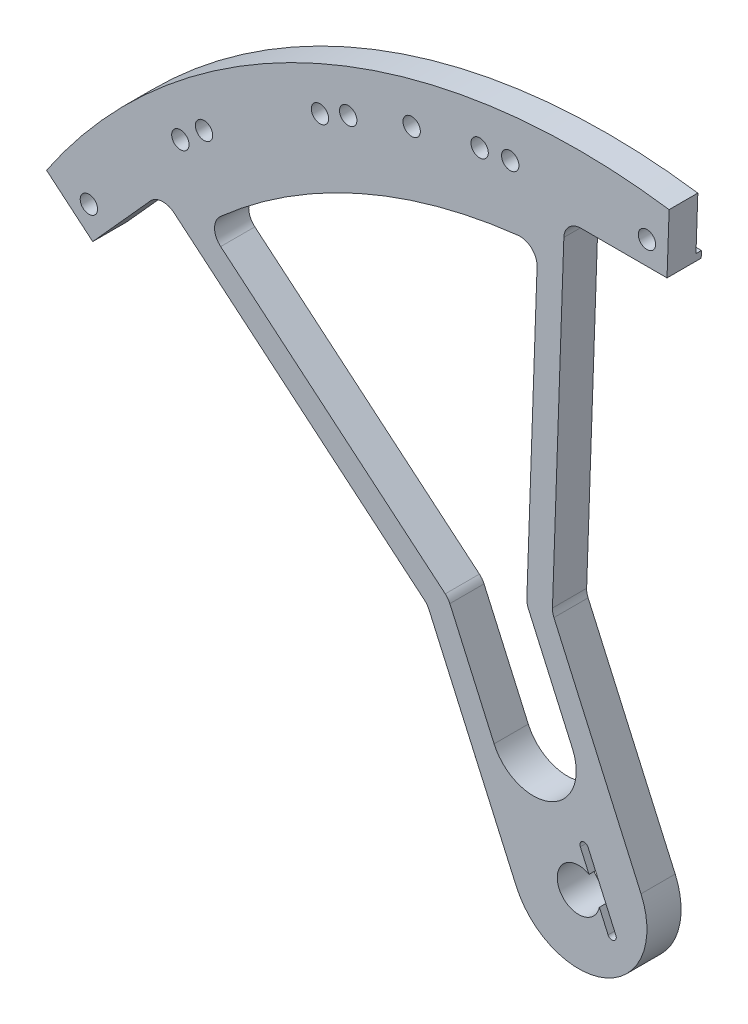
ISO-10303-21;
HEADER;
FILE_DESCRIPTION(('STEP AP214'),'2;1');
FILE_NAME('part.step','',(''),(''),'','','');
FILE_SCHEMA(('AUTOMOTIVE_DESIGN { 1 0 10303 214 1 1 1 1 }'));
ENDSEC;
DATA;
#1=APPLICATION_CONTEXT('core data for automotive mechanical design processes');
#2=APPLICATION_PROTOCOL_DEFINITION('international standard','automotive_design',2000,#1);
#3=PRODUCT_CONTEXT('',#1,'mechanical');
#4=PRODUCT('Part','Part','',(#3));
#5=PRODUCT_RELATED_PRODUCT_CATEGORY('part','',(#4));
#6=PRODUCT_DEFINITION_FORMATION('','',#4);
#7=PRODUCT_DEFINITION_CONTEXT('part definition',#1,'design');
#8=PRODUCT_DEFINITION('design','',#6,#7);
#9=PRODUCT_DEFINITION_SHAPE('','',#8);
#10=(LENGTH_UNIT() NAMED_UNIT(*) SI_UNIT(.MILLI.,.METRE.));
#11=(NAMED_UNIT(*) PLANE_ANGLE_UNIT() SI_UNIT($,.RADIAN.));
#12=(NAMED_UNIT(*) SI_UNIT($,.STERADIAN.) SOLID_ANGLE_UNIT());
#13=UNCERTAINTY_MEASURE_WITH_UNIT(LENGTH_MEASURE(1.E-05),#10,'distance_accuracy_value','');
#14=(GEOMETRIC_REPRESENTATION_CONTEXT(3) GLOBAL_UNCERTAINTY_ASSIGNED_CONTEXT((#13)) GLOBAL_UNIT_ASSIGNED_CONTEXT((#10,
#11,#12)) REPRESENTATION_CONTEXT('',''));
#15=CARTESIAN_POINT('',(0.,0.,0.));
#16=DIRECTION('',(0.,0.,1.));
#17=DIRECTION('',(1.,0.,0.));
#18=AXIS2_PLACEMENT_3D('',#15,#16,#17);
#19=CARTESIAN_POINT('',(0.,-66.6750000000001,-3.175));
#20=DIRECTION('',(0.,0.,1.));
#21=DIRECTION('',(1.,0.,0.));
#22=AXIS2_PLACEMENT_3D('',#19,#20,#21);
#23=CYLINDRICAL_SURFACE('',#22,59.53125);
#24=DIRECTION('',(0.,0.,1.));
#25=VECTOR('',#24,1.);
#26=CARTESIAN_POINT('',(8.41188930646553,-7.74105524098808,-3.175));
#27=LINE('',#26,#25);
#28=CARTESIAN_POINT('',(8.41188930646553,-7.74105524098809,-2.667));
#29=VERTEX_POINT('',#28);
#30=CARTESIAN_POINT('',(8.41188930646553,-7.74105524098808,0.));
#31=VERTEX_POINT('',#30);
#32=EDGE_CURVE('E582',#29,#31,#27,.T.);
#33=ORIENTED_EDGE('',*,*,#32,.F.);
#34=CARTESIAN_POINT('',(0.,-66.6750000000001,-2.667));
#35=DIRECTION('',(0.,0.,-1.));
#36=DIRECTION('',(-1.,0.,0.));
#37=AXIS2_PLACEMENT_3D('',#34,#35,#36);
#38=CIRCLE('',#37,59.53125);
#39=CARTESIAN_POINT('',(-49.42510868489,-33.4917458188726,-2.667));
#40=VERTEX_POINT('',#39);
#41=EDGE_CURVE('E528',#40,#29,#38,.T.);
#42=ORIENTED_EDGE('',*,*,#41,.F.);
#43=DIRECTION('',(0.,0.,1.));
#44=VECTOR('',#43,1.);
#45=CARTESIAN_POINT('',(-49.42510868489,-33.4917458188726,-3.175));
#46=LINE('',#45,#44);
#47=CARTESIAN_POINT('',(-49.42510868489,-33.4917458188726,0.));
#48=VERTEX_POINT('',#47);
#49=EDGE_CURVE('E591',#40,#48,#46,.T.);
#50=ORIENTED_EDGE('',*,*,#49,.T.);
#51=CARTESIAN_POINT('',(0.,-66.6750000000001,0.));
#52=DIRECTION('',(0.,0.,1.));
#53=DIRECTION('',(1.,0.,0.));
#54=AXIS2_PLACEMENT_3D('',#51,#52,#53);
#55=CIRCLE('',#54,59.53125);
#56=EDGE_CURVE('E586',#31,#48,#55,.T.);
#57=ORIENTED_EDGE('',*,*,#56,.F.);
#58=EDGE_LOOP('',(#33,#42,#50,#57));
#59=FACE_BOUND('',#58,.T.);
#60=ADVANCED_FACE('F39',(#59),#23,.T.);
#61=CARTESIAN_POINT('',(0.,-66.6750000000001,-3.175));
#62=DIRECTION('',(0.,0.,1.));
#63=DIRECTION('',(1.,0.,0.));
#64=AXIS2_PLACEMENT_3D('',#61,#62,#63);
#65=CYLINDRICAL_SURFACE('',#64,6.35);
#66=CARTESIAN_POINT('',(0.,-66.6750000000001,0.));
#67=DIRECTION('',(0.,0.,1.));
#68=DIRECTION('',(1.,0.,0.));
#69=AXIS2_PLACEMENT_3D('',#66,#67,#68);
#70=CIRCLE('',#69,6.35);
#71=CARTESIAN_POINT('',(-5.80101365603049,-69.2577776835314,0.));
#72=VERTEX_POINT('',#71);
#73=CARTESIAN_POINT('',(5.8010136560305,-64.0922223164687,0.));
#74=VERTEX_POINT('',#73);
#75=EDGE_CURVE('E571',#72,#74,#70,.T.);
#76=ORIENTED_EDGE('',*,*,#75,.F.);
#77=DIRECTION('',(0.,0.,-1.));
#78=VECTOR('',#77,1.);
#79=CARTESIAN_POINT('',(-5.80101365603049,-69.2577776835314,0.));
#80=LINE('',#79,#78);
#81=CARTESIAN_POINT('',(-5.80101365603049,-69.2577776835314,-3.175));
#82=VERTEX_POINT('',#81);
#83=EDGE_CURVE('E416',#72,#82,#80,.T.);
#84=ORIENTED_EDGE('',*,*,#83,.T.);
#85=CARTESIAN_POINT('',(0.,-66.6750000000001,-3.175));
#86=DIRECTION('',(0.,0.,1.));
#87=DIRECTION('',(1.,0.,0.));
#88=AXIS2_PLACEMENT_3D('',#85,#86,#87);
#89=CIRCLE('',#88,6.35);
#90=CARTESIAN_POINT('',(5.8010136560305,-64.0922223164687,-3.175));
#91=VERTEX_POINT('',#90);
#92=EDGE_CURVE('E574',#82,#91,#89,.T.);
#93=ORIENTED_EDGE('',*,*,#92,.T.);
#94=DIRECTION('',(0.,0.,-1.));
#95=VECTOR('',#94,1.);
#96=CARTESIAN_POINT('',(5.8010136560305,-64.0922223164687,0.));
#97=LINE('',#96,#95);
#98=EDGE_CURVE('E461',#74,#91,#97,.T.);
#99=ORIENTED_EDGE('',*,*,#98,.F.);
#100=EDGE_LOOP('',(#76,#84,#93,#99));
#101=FACE_BOUND('',#100,.T.);
#102=ADVANCED_FACE('F41',(#101),#65,.T.);
#103=CARTESIAN_POINT('',(-4.08170132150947,-71.5393822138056,-3.175));
#104=DIRECTION('',(-0.642787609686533,-0.766044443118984,0.));
#105=DIRECTION('',(0.766044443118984,-0.642787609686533,0.));
#106=AXIS2_PLACEMENT_3D('',#103,#104,#105);
#107=PLANE('',#106);
#108=DIRECTION('',(0.,0.,-1.));
#109=VECTOR('',#108,1.);
#110=CARTESIAN_POINT('',(-45.137286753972,-37.0896556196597,0.));
#111=LINE('',#110,#109);
#112=CARTESIAN_POINT('',(-45.137286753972,-37.0896556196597,0.));
#113=VERTEX_POINT('',#112);
#114=CARTESIAN_POINT('',(-45.137286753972,-37.0896556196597,-3.175));
#115=VERTEX_POINT('',#114);
#116=EDGE_CURVE('E402',#113,#115,#111,.T.);
#117=ORIENTED_EDGE('',*,*,#116,.F.);
#118=DIRECTION('',(0.766044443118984,-0.642787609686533,0.));
#119=VECTOR('',#118,1.);
#120=CARTESIAN_POINT('',(-4.08170132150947,-71.5393822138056,0.));
#121=LINE('',#120,#119);
#122=EDGE_CURVE('E577',#48,#113,#121,.T.);
#123=ORIENTED_EDGE('',*,*,#122,.F.);
#124=ORIENTED_EDGE('',*,*,#49,.F.);
#125=DIRECTION('',(-0.766044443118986,0.642787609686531,0.));
#126=VECTOR('',#125,1.);
#127=CARTESIAN_POINT('',(-45.624021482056,-36.6812366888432,-2.667));
#128=LINE('',#127,#126);
#129=CARTESIAN_POINT('',(-45.624021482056,-36.6812366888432,-2.667));
#130=VERTEX_POINT('',#129);
#131=EDGE_CURVE('E526',#130,#40,#128,.T.);
#132=ORIENTED_EDGE('',*,*,#131,.F.);
#133=DIRECTION('',(0.,0.,-1.));
#134=VECTOR('',#133,1.);
#135=CARTESIAN_POINT('',(-45.624021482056,-36.6812366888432,-2.667));
#136=LINE('',#135,#134);
#137=CARTESIAN_POINT('',(-45.624021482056,-36.6812366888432,-3.175));
#138=VERTEX_POINT('',#137);
#139=EDGE_CURVE('E556',#130,#138,#136,.T.);
#140=ORIENTED_EDGE('',*,*,#139,.T.);
#141=DIRECTION('',(0.766044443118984,-0.642787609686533,0.));
#142=VECTOR('',#141,1.);
#143=CARTESIAN_POINT('',(-4.08170132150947,-71.5393822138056,-3.175));
#144=LINE('',#143,#142);
#145=EDGE_CURVE('E579',#138,#115,#144,.T.);
#146=ORIENTED_EDGE('',*,*,#145,.T.);
#147=EDGE_LOOP('',(#117,#123,#124,#132,#140,#146));
#148=FACE_BOUND('',#147,.T.);
#149=ADVANCED_FACE('F630',(#148),#107,.T.);
#150=CARTESIAN_POINT('',(8.41188930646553,-7.74105524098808,-3.175));
#151=DIRECTION('',(0.999390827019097,-0.0348994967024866,0.));
#152=DIRECTION('',(0.0348994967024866,0.999390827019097,0.));
#153=AXIS2_PLACEMENT_3D('',#150,#151,#152);
#154=PLANE('',#153);
#155=DIRECTION('',(0.,0.,-1.));
#156=VECTOR('',#155,1.);
#157=CARTESIAN_POINT('',(8.21654446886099,-13.3349994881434,0.));
#158=LINE('',#157,#156);
#159=CARTESIAN_POINT('',(8.21654446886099,-13.3349994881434,0.));
#160=VERTEX_POINT('',#159);
#161=CARTESIAN_POINT('',(8.21654446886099,-13.3349994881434,-3.175));
#162=VERTEX_POINT('',#161);
#163=EDGE_CURVE('E464',#160,#162,#158,.T.);
#164=ORIENTED_EDGE('',*,*,#163,.T.);
#165=DIRECTION('',(0.0348994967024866,0.999390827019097,0.));
#166=VECTOR('',#165,1.);
#167=CARTESIAN_POINT('',(8.41188930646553,-7.74105524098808,-3.175));
#168=LINE('',#167,#166);
#169=CARTESIAN_POINT('',(8.23871913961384,-12.7,-3.175));
#170=VERTEX_POINT('',#169);
#171=EDGE_CURVE('E576',#162,#170,#168,.T.);
#172=ORIENTED_EDGE('',*,*,#171,.T.);
#173=DIRECTION('',(0.,0.,-1.));
#174=VECTOR('',#173,1.);
#175=CARTESIAN_POINT('',(8.23871913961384,-12.7,-2.667));
#176=LINE('',#175,#174);
#177=CARTESIAN_POINT('',(8.23871913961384,-12.7,-2.667));
#178=VERTEX_POINT('',#177);
#179=EDGE_CURVE('E546',#178,#170,#176,.T.);
#180=ORIENTED_EDGE('',*,*,#179,.F.);
#181=DIRECTION('',(-0.0348994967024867,-0.999390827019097,0.));
#182=VECTOR('',#181,1.);
#183=CARTESIAN_POINT('',(8.41188930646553,-7.74105524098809,-2.667));
#184=LINE('',#183,#182);
#185=EDGE_CURVE('E531',#29,#178,#184,.T.);
#186=ORIENTED_EDGE('',*,*,#185,.F.);
#187=ORIENTED_EDGE('',*,*,#32,.T.);
#188=DIRECTION('',(0.0348994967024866,0.999390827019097,0.));
#189=VECTOR('',#188,1.);
#190=CARTESIAN_POINT('',(8.41188930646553,-7.74105524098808,0.));
#191=LINE('',#190,#189);
#192=EDGE_CURVE('E584',#160,#31,#191,.T.);
#193=ORIENTED_EDGE('',*,*,#192,.F.);
#194=EDGE_LOOP('',(#164,#172,#180,#186,#187,#193));
#195=FACE_BOUND('',#194,.T.);
#196=ADVANCED_FACE('F635',(#195),#154,.T.);
#197=CARTESIAN_POINT('',(0.,-66.6750000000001,-3.175));
#198=DIRECTION('',(0.,0.,1.));
#199=DIRECTION('',(1.,0.,0.));
#200=AXIS2_PLACEMENT_3D('',#197,#198,#199);
#201=PLANE('',#200);
#202=DIRECTION('',(-0.406736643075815,0.913545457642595,0.));
#203=VECTOR('',#202,1.);
#204=CARTESIAN_POINT('',(-11.9571419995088,-49.6231978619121,-3.175));
#205=LINE('',#204,#203);
#206=CARTESIAN_POINT('',(-7.84779864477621,-58.8529341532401,-3.175));
#207=VERTEX_POINT('',#206);
#208=CARTESIAN_POINT('',(-11.9571419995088,-49.6231978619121,-3.175));
#209=VERTEX_POINT('',#208);
#210=EDGE_CURVE('E340',#207,#209,#205,.T.);
#211=ORIENTED_EDGE('',*,*,#210,.F.);
#212=CARTESIAN_POINT('',(-4.20476206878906,-57.2309497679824,-3.175));
#213=DIRECTION('',(0.,0.,-1.));
#214=DIRECTION('',(-1.,0.,0.));
#215=AXIS2_PLACEMENT_3D('',#212,#213,#214);
#216=CIRCLE('',#215,3.98779999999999);
#217=CARTESIAN_POINT('',(-0.56172549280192,-55.6089653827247,-3.175));
#218=VERTEX_POINT('',#217);
#219=EDGE_CURVE('E62',#218,#207,#216,.T.);
#220=ORIENTED_EDGE('',*,*,#219,.F.);
#221=DIRECTION('',(0.406736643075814,-0.913545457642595,0.));
#222=VECTOR('',#221,1.);
#223=CARTESIAN_POINT('',(-4.67106884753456,-46.3792290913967,-3.175));
#224=LINE('',#223,#222);
#225=CARTESIAN_POINT('',(-4.67106884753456,-46.3792290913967,-3.175));
#226=VERTEX_POINT('',#225);
#227=EDGE_CURVE('E311',#226,#218,#224,.T.);
#228=ORIENTED_EDGE('',*,*,#227,.F.);
#229=CARTESIAN_POINT('',(-3.22081543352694,-45.7335346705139,-3.175));
#230=DIRECTION('',(0.,0.,1.));
#231=DIRECTION('',(1.,0.,0.));
#232=AXIS2_PLACEMENT_3D('',#229,#230,#231);
#233=CIRCLE('',#232,1.5875);
#234=CARTESIAN_POINT('',(-4.80734837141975,-45.6781317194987,-3.175));
#235=VERTEX_POINT('',#234);
#236=EDGE_CURVE('E361',#235,#226,#233,.T.);
#237=ORIENTED_EDGE('',*,*,#236,.F.);
#238=DIRECTION('',(-0.0348994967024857,-0.999390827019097,0.));
#239=VECTOR('',#238,1.);
#240=CARTESIAN_POINT('',(-3.85682993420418,-18.4588450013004,-3.175));
#241=LINE('',#240,#239);
#242=CARTESIAN_POINT('',(-3.85682993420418,-18.4588450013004,-3.175));
#243=VERTEX_POINT('',#242);
#244=EDGE_CURVE('E358',#243,#235,#241,.T.);
#245=ORIENTED_EDGE('',*,*,#244,.F.);
#246=CARTESIAN_POINT('',(-5.44336287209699,-18.4034420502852,-3.175));
#247=DIRECTION('',(0.,0.,-1.));
#248=DIRECTION('',(1.,0.,0.));
#249=AXIS2_PLACEMENT_3D('',#246,#247,#248);
#250=CIRCLE('',#249,1.5875);
#251=CARTESIAN_POINT('',(-5.62125054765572,-16.8259401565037,-3.175));
#252=VERTEX_POINT('',#251);
#253=EDGE_CURVE('E355',#252,#243,#250,.T.);
#254=ORIENTED_EDGE('',*,*,#253,.F.);
#255=CARTESIAN_POINT('',(0.,-66.6750000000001,-3.175));
#256=DIRECTION('',(0.,0.,-1.));
#257=DIRECTION('',(-1.,0.,0.));
#258=AXIS2_PLACEMENT_3D('',#255,#256,#257);
#259=CIRCLE('',#258,50.165);
#260=CARTESIAN_POINT('',(-33.2837200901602,-29.1420651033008,-3.175));
#261=VERTEX_POINT('',#260);
#262=EDGE_CURVE('E352',#261,#252,#259,.T.);
#263=ORIENTED_EDGE('',*,*,#262,.F.);
#264=CARTESIAN_POINT('',(-32.2304378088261,-30.3298162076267,-3.175));
#265=DIRECTION('',(0.,0.,-1.));
#266=DIRECTION('',(-1.,0.,0.));
#267=AXIS2_PLACEMENT_3D('',#264,#265,#266);
#268=CIRCLE('',#267,1.5875);
#269=CARTESIAN_POINT('',(-33.2508631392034,-31.5459117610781,-3.175));
#270=VERTEX_POINT('',#269);
#271=EDGE_CURVE('E349',#270,#261,#268,.T.);
#272=ORIENTED_EDGE('',*,*,#271,.F.);
#273=DIRECTION('',(-0.766044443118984,0.642787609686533,0.));
#274=VECTOR('',#273,1.);
#275=CARTESIAN_POINT('',(-33.2508631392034,-31.5459117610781,-3.175));
#276=LINE('',#275,#274);
#277=CARTESIAN_POINT('',(-12.3869700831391,-49.0527967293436,-3.175));
#278=VERTEX_POINT('',#277);
#279=EDGE_CURVE('E346',#278,#270,#276,.T.);
#280=ORIENTED_EDGE('',*,*,#279,.F.);
#281=CARTESIAN_POINT('',(-13.4073954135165,-50.268892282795,-3.175));
#282=DIRECTION('',(0.,0.,1.));
#283=DIRECTION('',(-1.,0.,0.));
#284=AXIS2_PLACEMENT_3D('',#281,#282,#283);
#285=CIRCLE('',#284,1.5875);
#286=EDGE_CURVE('E343',#209,#278,#285,.T.);
#287=ORIENTED_EDGE('',*,*,#286,.F.);
#288=EDGE_LOOP('',(#211,#220,#228,#237,#245,#254,#263,#272,#280,#287));
#289=FACE_BOUND('',#288,.T.);
#290=CARTESIAN_POINT('',(0.,-66.6750000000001,-3.175));
#291=DIRECTION('',(0.,0.,1.));
#292=DIRECTION('',(1.,0.,0.));
#293=AXIS2_PLACEMENT_3D('',#290,#291,#292);
#294=CIRCLE('',#293,1.9812);
#295=CARTESIAN_POINT('',(1.98120000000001,-66.6750000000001,-3.175));
#296=VERTEX_POINT('',#295);
#297=EDGE_CURVE('E568',#296,#296,#294,.T.);
#298=ORIENTED_EDGE('',*,*,#297,.T.);
#299=EDGE_LOOP('',(#298));
#300=FACE_BOUND('',#299,.T.);
#301=ORIENTED_EDGE('',*,*,#92,.F.);
#302=DIRECTION('',(0.406736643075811,-0.913545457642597,0.));
#303=VECTOR('',#302,1.);
#304=CARTESIAN_POINT('',(-13.8933024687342,-51.0821994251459,-3.175));
#305=LINE('',#304,#303);
#306=CARTESIAN_POINT('',(-13.8933024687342,-51.0821994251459,-3.175));
#307=VERTEX_POINT('',#306);
#308=EDGE_CURVE('E390',#307,#82,#305,.T.);
#309=ORIENTED_EDGE('',*,*,#308,.F.);
#310=CARTESIAN_POINT('',(-15.3435558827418,-51.7278938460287,-3.175));
#311=DIRECTION('',(0.,0.,-1.));
#312=DIRECTION('',(-1.,0.,0.));
#313=AXIS2_PLACEMENT_3D('',#310,#311,#312);
#314=CIRCLE('',#313,1.5875);
#315=CARTESIAN_POINT('',(-14.3231305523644,-50.5117982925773,-3.175));
#316=VERTEX_POINT('',#315);
#317=EDGE_CURVE('E411',#316,#307,#314,.T.);
#318=ORIENTED_EDGE('',*,*,#317,.F.);
#319=DIRECTION('',(0.766044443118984,-0.642787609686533,0.));
#320=VECTOR('',#319,1.);
#321=CARTESIAN_POINT('',(-14.3231305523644,-50.5117982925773,-3.175));
#322=LINE('',#321,#320);
#323=CARTESIAN_POINT('',(-37.5855626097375,-30.9923001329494,-3.175));
#324=VERTEX_POINT('',#323);
#325=EDGE_CURVE('E408',#324,#316,#322,.T.);
#326=ORIENTED_EDGE('',*,*,#325,.F.);
#327=CARTESIAN_POINT('',(-38.6059879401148,-32.2083956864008,-3.175));
#328=DIRECTION('',(0.,0.,-1.));
#329=DIRECTION('',(1.,0.,0.));
#330=AXIS2_PLACEMENT_3D('',#327,#328,#329);
#331=CIRCLE('',#330,1.58750000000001);
#332=CARTESIAN_POINT('',(-39.7857302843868,-31.1461507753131,-3.175));
#333=VERTEX_POINT('',#332);
#334=EDGE_CURVE('E405',#333,#324,#331,.T.);
#335=ORIENTED_EDGE('',*,*,#334,.F.);
#336=DIRECTION('',(0.66913065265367,0.743144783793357,0.));
#337=VECTOR('',#336,1.);
#338=CARTESIAN_POINT('',(-39.7857302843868,-31.1461507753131,-3.175));
#339=LINE('',#338,#337);
#340=EDGE_CURVE('E368',#115,#333,#339,.T.);
#341=ORIENTED_EDGE('',*,*,#340,.F.);
#342=ORIENTED_EDGE('',*,*,#145,.F.);
#343=DIRECTION('',(-0.669130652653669,-0.743144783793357,0.));
#344=VECTOR('',#343,1.);
#345=CARTESIAN_POINT('',(-45.624021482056,-36.6812366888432,-3.175));
#346=LINE('',#345,#344);
#347=CARTESIAN_POINT('',(-35.0354209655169,-24.9214059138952,-3.175));
#348=VERTEX_POINT('',#347);
#349=EDGE_CURVE('E529',#348,#138,#346,.T.);
#350=ORIENTED_EDGE('',*,*,#349,.F.);
#351=DIRECTION('',(-0.848048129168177,-0.529919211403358,0.));
#352=VECTOR('',#351,1.);
#353=CARTESIAN_POINT('',(-35.0354209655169,-24.9214059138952,-3.175));
#354=LINE('',#353,#352);
#355=CARTESIAN_POINT('',(-22.1693579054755,-16.8817985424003,-3.175));
#356=VERTEX_POINT('',#355);
#357=EDGE_CURVE('E552',#356,#348,#354,.T.);
#358=ORIENTED_EDGE('',*,*,#357,.F.);
#359=DIRECTION('',(-0.96126171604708,-0.275637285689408,0.));
#360=VECTOR('',#359,1.);
#361=CARTESIAN_POINT('',(-22.1693579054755,-16.8817985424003,-3.175));
#362=LINE('',#361,#360);
#363=CARTESIAN_POINT('',(-7.58568925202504,-12.7,-3.175));
#364=VERTEX_POINT('',#363);
#365=EDGE_CURVE('E549',#364,#356,#362,.T.);
#366=ORIENTED_EDGE('',*,*,#365,.F.);
#367=DIRECTION('',(-1.,0.,0.));
#368=VECTOR('',#367,1.);
#369=CARTESIAN_POINT('',(-7.58568925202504,-12.7,-3.175));
#370=LINE('',#369,#368);
#371=EDGE_CURVE('E525',#170,#364,#370,.T.);
#372=ORIENTED_EDGE('',*,*,#371,.F.);
#373=ORIENTED_EDGE('',*,*,#171,.F.);
#374=DIRECTION('',(0.999999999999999,6.2295837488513E-08,0.));
#375=VECTOR('',#374,1.);
#376=CARTESIAN_POINT('',(0.21876937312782,-13.3349999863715,-3.175));
#377=LINE('',#376,#375);
#378=CARTESIAN_POINT('',(0.21876937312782,-13.3349999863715,-3.175));
#379=VERTEX_POINT('',#378);
#380=EDGE_CURVE('E454',#379,#162,#377,.T.);
#381=ORIENTED_EDGE('',*,*,#380,.F.);
#382=CARTESIAN_POINT('',(0.218769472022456,-14.9224999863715,-3.175));
#383=DIRECTION('',(0.,0.,-1.));
#384=DIRECTION('',(-1.,0.,0.));
#385=AXIS2_PLACEMENT_3D('',#382,#383,#384);
#386=CIRCLE('',#385,1.58750000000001);
#387=CARTESIAN_POINT('',(-1.36776346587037,-14.8670970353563,-3.175));
#388=VERTEX_POINT('',#387);
#389=EDGE_CURVE('E451',#388,#379,#386,.T.);
#390=ORIENTED_EDGE('',*,*,#389,.F.);
#391=DIRECTION('',(0.0348994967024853,0.999390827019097,0.));
#392=VECTOR('',#391,1.);
#393=CARTESIAN_POINT('',(-2.42755468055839,-45.215546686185,-3.175));
#394=LINE('',#393,#392);
#395=CARTESIAN_POINT('',(-2.42755468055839,-45.215546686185,-3.175));
#396=VERTEX_POINT('',#395);
#397=EDGE_CURVE('E448',#396,#388,#394,.T.);
#398=ORIENTED_EDGE('',*,*,#397,.F.);
#399=CARTESIAN_POINT('',(-0.841021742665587,-45.2709496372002,-3.175));
#400=DIRECTION('',(0.,0.,-1.));
#401=DIRECTION('',(1.,0.,0.));
#402=AXIS2_PLACEMENT_3D('',#399,#400,#401);
#403=CIRCLE('',#402,1.58749999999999);
#404=CARTESIAN_POINT('',(-2.29127515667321,-45.916644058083,-3.175));
#405=VERTEX_POINT('',#404);
#406=EDGE_CURVE('E419',#405,#396,#403,.T.);
#407=ORIENTED_EDGE('',*,*,#406,.F.);
#408=DIRECTION('',(-0.406736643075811,0.913545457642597,0.));
#409=VECTOR('',#408,1.);
#410=CARTESIAN_POINT('',(-2.29127515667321,-45.916644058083,-3.175));
#411=LINE('',#410,#409);
#412=EDGE_CURVE('E433',#91,#405,#411,.T.);
#413=ORIENTED_EDGE('',*,*,#412,.F.);
#414=EDGE_LOOP('',(#301,#309,#318,#326,#335,#341,#342,#350,#358,#366,#372,#373,#381,#390,#398,
#407,#413));
#415=FACE_BOUND('',#414,.T.);
#416=ADVANCED_FACE('F637',(#289,#300,#415),#201,.F.);
#417=CARTESIAN_POINT('',(0.,-66.6750000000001,0.));
#418=DIRECTION('',(0.,0.,1.));
#419=DIRECTION('',(1.,0.,0.));
#420=AXIS2_PLACEMENT_3D('',#417,#418,#419);
#421=PLANE('',#420);
#422=DIRECTION('',(0.406736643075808,-0.913545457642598,0.));
#423=VECTOR('',#422,1.);
#424=CARTESIAN_POINT('',(0.160024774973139,-63.1282821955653,0.));
#425=LINE('',#424,#423);
#426=CARTESIAN_POINT('',(0.160024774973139,-63.1282821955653,0.));
#427=VERTEX_POINT('',#426);
#428=CARTESIAN_POINT('',(0.969990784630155,-64.9474956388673,0.));
#429=VERTEX_POINT('',#428);
#430=EDGE_CURVE('E297',#427,#429,#425,.T.);
#431=ORIENTED_EDGE('',*,*,#430,.F.);
#432=CARTESIAN_POINT('',(0.522008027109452,-62.9671168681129,0.));
#433=DIRECTION('',(0.,0.,1.));
#434=DIRECTION('',(1.,0.,0.));
#435=AXIS2_PLACEMENT_3D('',#432,#433,#434);
#436=CIRCLE('',#435,0.396240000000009);
#437=CARTESIAN_POINT('',(0.883991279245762,-62.8059515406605,0.));
#438=VERTEX_POINT('',#437);
#439=EDGE_CURVE('E272',#438,#427,#436,.T.);
#440=ORIENTED_EDGE('',*,*,#439,.F.);
#441=DIRECTION('',(-0.406736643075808,0.913545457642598,0.));
#442=VECTOR('',#441,1.);
#443=CARTESIAN_POINT('',(0.883991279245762,-62.8059515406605,0.));
#444=LINE('',#443,#442);
#445=CARTESIAN_POINT('',(3.46676896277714,-68.606965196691,0.));
#446=VERTEX_POINT('',#445);
#447=EDGE_CURVE('E287',#446,#438,#444,.T.);
#448=ORIENTED_EDGE('',*,*,#447,.F.);
#449=CARTESIAN_POINT('',(3.10478571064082,-68.7681305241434,0.));
#450=DIRECTION('',(0.,0.,1.));
#451=DIRECTION('',(1.,0.,0.));
#452=AXIS2_PLACEMENT_3D('',#449,#450,#451);
#453=CIRCLE('',#452,0.396240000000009);
#454=CARTESIAN_POINT('',(2.74280245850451,-68.9292958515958,0.));
#455=VERTEX_POINT('',#454);
#456=EDGE_CURVE('E290',#455,#446,#453,.T.);
#457=ORIENTED_EDGE('',*,*,#456,.F.);
#458=CARTESIAN_POINT('',(1.93283644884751,-67.1100824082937,0.));
#459=VERTEX_POINT('',#458);
#460=EDGE_CURVE('E296',#459,#455,#425,.T.);
#461=ORIENTED_EDGE('',*,*,#460,.F.);
#462=CARTESIAN_POINT('',(0.,-66.6750000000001,0.));
#463=DIRECTION('',(0.,0.,1.));
#464=DIRECTION('',(1.,0.,0.));
#465=AXIS2_PLACEMENT_3D('',#462,#463,#464);
#466=CIRCLE('',#465,1.9812);
#467=EDGE_CURVE('E559',#429,#459,#466,.T.);
#468=ORIENTED_EDGE('',*,*,#467,.F.);
#469=EDGE_LOOP('',(#431,#440,#448,#457,#461,#468));
#470=FACE_BOUND('',#469,.T.);
#471=CARTESIAN_POINT('',(-4.20476206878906,-57.2309497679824,0.));
#472=DIRECTION('',(0.,0.,-1.));
#473=DIRECTION('',(-1.,0.,0.));
#474=AXIS2_PLACEMENT_3D('',#471,#472,#473);
#475=CIRCLE('',#474,3.98779999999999);
#476=CARTESIAN_POINT('',(-0.56172549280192,-55.6089653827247,0.));
#477=VERTEX_POINT('',#476);
#478=CARTESIAN_POINT('',(-7.84779864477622,-58.8529341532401,0.));
#479=VERTEX_POINT('',#478);
#480=EDGE_CURVE('E307',#477,#479,#475,.T.);
#481=ORIENTED_EDGE('',*,*,#480,.T.);
#482=DIRECTION('',(-0.406736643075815,0.913545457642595,0.));
#483=VECTOR('',#482,1.);
#484=CARTESIAN_POINT('',(-11.9571419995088,-49.6231978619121,0.));
#485=LINE('',#484,#483);
#486=CARTESIAN_POINT('',(-11.9571419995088,-49.6231978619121,0.));
#487=VERTEX_POINT('',#486);
#488=EDGE_CURVE('E310',#479,#487,#485,.T.);
#489=ORIENTED_EDGE('',*,*,#488,.T.);
#490=CARTESIAN_POINT('',(-13.4073954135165,-50.268892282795,0.));
#491=DIRECTION('',(0.,0.,1.));
#492=DIRECTION('',(-1.,0.,0.));
#493=AXIS2_PLACEMENT_3D('',#490,#491,#492);
#494=CIRCLE('',#493,1.5875);
#495=CARTESIAN_POINT('',(-12.3869700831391,-49.0527967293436,0.));
#496=VERTEX_POINT('',#495);
#497=EDGE_CURVE('E314',#487,#496,#494,.T.);
#498=ORIENTED_EDGE('',*,*,#497,.T.);
#499=DIRECTION('',(-0.766044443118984,0.642787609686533,0.));
#500=VECTOR('',#499,1.);
#501=CARTESIAN_POINT('',(-33.2508631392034,-31.5459117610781,0.));
#502=LINE('',#501,#500);
#503=CARTESIAN_POINT('',(-33.2508631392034,-31.5459117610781,0.));
#504=VERTEX_POINT('',#503);
#505=EDGE_CURVE('E317',#496,#504,#502,.T.);
#506=ORIENTED_EDGE('',*,*,#505,.T.);
#507=CARTESIAN_POINT('',(-32.2304378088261,-30.3298162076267,0.));
#508=DIRECTION('',(0.,0.,-1.));
#509=DIRECTION('',(-1.,0.,0.));
#510=AXIS2_PLACEMENT_3D('',#507,#508,#509);
#511=CIRCLE('',#510,1.5875);
#512=CARTESIAN_POINT('',(-33.2837200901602,-29.1420651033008,0.));
#513=VERTEX_POINT('',#512);
#514=EDGE_CURVE('E320',#504,#513,#511,.T.);
#515=ORIENTED_EDGE('',*,*,#514,.T.);
#516=CARTESIAN_POINT('',(0.,-66.6750000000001,0.));
#517=DIRECTION('',(0.,0.,-1.));
#518=DIRECTION('',(-1.,0.,0.));
#519=AXIS2_PLACEMENT_3D('',#516,#517,#518);
#520=CIRCLE('',#519,50.165);
#521=CARTESIAN_POINT('',(-5.62125054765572,-16.8259401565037,0.));
#522=VERTEX_POINT('',#521);
#523=EDGE_CURVE('E323',#513,#522,#520,.T.);
#524=ORIENTED_EDGE('',*,*,#523,.T.);
#525=CARTESIAN_POINT('',(-5.443362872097,-18.4034420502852,0.));
#526=DIRECTION('',(0.,0.,-1.));
#527=DIRECTION('',(1.,0.,0.));
#528=AXIS2_PLACEMENT_3D('',#525,#526,#527);
#529=CIRCLE('',#528,1.5875);
#530=CARTESIAN_POINT('',(-3.85682993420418,-18.4588450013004,0.));
#531=VERTEX_POINT('',#530);
#532=EDGE_CURVE('E326',#522,#531,#529,.T.);
#533=ORIENTED_EDGE('',*,*,#532,.T.);
#534=DIRECTION('',(-0.0348994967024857,-0.999390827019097,0.));
#535=VECTOR('',#534,1.);
#536=CARTESIAN_POINT('',(-3.85682993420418,-18.4588450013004,0.));
#537=LINE('',#536,#535);
#538=CARTESIAN_POINT('',(-4.80734837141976,-45.6781317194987,0.));
#539=VERTEX_POINT('',#538);
#540=EDGE_CURVE('E329',#531,#539,#537,.T.);
#541=ORIENTED_EDGE('',*,*,#540,.T.);
#542=CARTESIAN_POINT('',(-3.22081543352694,-45.7335346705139,0.));
#543=DIRECTION('',(0.,0.,1.));
#544=DIRECTION('',(1.,0.,0.));
#545=AXIS2_PLACEMENT_3D('',#542,#543,#544);
#546=CIRCLE('',#545,1.5875);
#547=CARTESIAN_POINT('',(-4.67106884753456,-46.3792290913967,0.));
#548=VERTEX_POINT('',#547);
#549=EDGE_CURVE('E332',#539,#548,#546,.T.);
#550=ORIENTED_EDGE('',*,*,#549,.T.);
#551=DIRECTION('',(0.406736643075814,-0.913545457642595,0.));
#552=VECTOR('',#551,1.);
#553=CARTESIAN_POINT('',(-4.67106884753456,-46.3792290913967,0.));
#554=LINE('',#553,#552);
#555=EDGE_CURVE('E335',#548,#477,#554,.T.);
#556=ORIENTED_EDGE('',*,*,#555,.T.);
#557=EDGE_LOOP('',(#481,#489,#498,#506,#515,#524,#533,#541,#550,#556));
#558=FACE_BOUND('',#557,.T.);
#559=DIRECTION('',(0.406736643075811,-0.913545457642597,0.));
#560=VECTOR('',#559,1.);
#561=CARTESIAN_POINT('',(-13.8933024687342,-51.0821994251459,0.));
#562=LINE('',#561,#560);
#563=CARTESIAN_POINT('',(-13.8933024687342,-51.0821994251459,0.));
#564=VERTEX_POINT('',#563);
#565=EDGE_CURVE('E399',#564,#72,#562,.T.);
#566=ORIENTED_EDGE('',*,*,#565,.T.);
#567=ORIENTED_EDGE('',*,*,#75,.T.);
#568=DIRECTION('',(-0.406736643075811,0.913545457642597,0.));
#569=VECTOR('',#568,1.);
#570=CARTESIAN_POINT('',(-2.29127515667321,-45.916644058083,0.));
#571=LINE('',#570,#569);
#572=CARTESIAN_POINT('',(-2.29127515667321,-45.916644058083,0.));
#573=VERTEX_POINT('',#572);
#574=EDGE_CURVE('E442',#74,#573,#571,.T.);
#575=ORIENTED_EDGE('',*,*,#574,.T.);
#576=CARTESIAN_POINT('',(-0.841021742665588,-45.2709496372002,0.));
#577=DIRECTION('',(0.,0.,-1.));
#578=DIRECTION('',(1.,0.,0.));
#579=AXIS2_PLACEMENT_3D('',#576,#577,#578);
#580=CIRCLE('',#579,1.58749999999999);
#581=CARTESIAN_POINT('',(-2.4275546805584,-45.215546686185,0.));
#582=VERTEX_POINT('',#581);
#583=EDGE_CURVE('E429',#573,#582,#580,.T.);
#584=ORIENTED_EDGE('',*,*,#583,.T.);
#585=DIRECTION('',(0.0348994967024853,0.999390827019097,0.));
#586=VECTOR('',#585,1.);
#587=CARTESIAN_POINT('',(-2.4275546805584,-45.215546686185,0.));
#588=LINE('',#587,#586);
#589=CARTESIAN_POINT('',(-1.36776346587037,-14.8670970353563,0.));
#590=VERTEX_POINT('',#589);
#591=EDGE_CURVE('E432',#582,#590,#588,.T.);
#592=ORIENTED_EDGE('',*,*,#591,.T.);
#593=CARTESIAN_POINT('',(0.218769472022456,-14.9224999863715,0.));
#594=DIRECTION('',(0.,0.,-1.));
#595=DIRECTION('',(-1.,0.,0.));
#596=AXIS2_PLACEMENT_3D('',#593,#594,#595);
#597=CIRCLE('',#596,1.58750000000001);
#598=CARTESIAN_POINT('',(0.21876937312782,-13.3349999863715,0.));
#599=VERTEX_POINT('',#598);
#600=EDGE_CURVE('E436',#590,#599,#597,.T.);
#601=ORIENTED_EDGE('',*,*,#600,.T.);
#602=DIRECTION('',(0.999999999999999,6.2295837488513E-08,0.));
#603=VECTOR('',#602,1.);
#604=CARTESIAN_POINT('',(0.21876937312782,-13.3349999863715,0.));
#605=LINE('',#604,#603);
#606=EDGE_CURVE('E439',#599,#160,#605,.T.);
#607=ORIENTED_EDGE('',*,*,#606,.T.);
#608=ORIENTED_EDGE('',*,*,#192,.T.);
#609=ORIENTED_EDGE('',*,*,#56,.T.);
#610=ORIENTED_EDGE('',*,*,#122,.T.);
#611=DIRECTION('',(0.66913065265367,0.743144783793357,0.));
#612=VECTOR('',#611,1.);
#613=CARTESIAN_POINT('',(-39.7857302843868,-31.1461507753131,0.));
#614=LINE('',#613,#612);
#615=CARTESIAN_POINT('',(-39.7857302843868,-31.1461507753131,0.));
#616=VERTEX_POINT('',#615);
#617=EDGE_CURVE('E386',#113,#616,#614,.T.);
#618=ORIENTED_EDGE('',*,*,#617,.T.);
#619=CARTESIAN_POINT('',(-38.6059879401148,-32.2083956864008,0.));
#620=DIRECTION('',(0.,0.,-1.));
#621=DIRECTION('',(1.,0.,0.));
#622=AXIS2_PLACEMENT_3D('',#619,#620,#621);
#623=CIRCLE('',#622,1.58750000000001);
#624=CARTESIAN_POINT('',(-37.5855626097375,-30.9923001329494,0.));
#625=VERTEX_POINT('',#624);
#626=EDGE_CURVE('E389',#616,#625,#623,.T.);
#627=ORIENTED_EDGE('',*,*,#626,.T.);
#628=DIRECTION('',(0.766044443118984,-0.642787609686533,0.));
#629=VECTOR('',#628,1.);
#630=CARTESIAN_POINT('',(-14.3231305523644,-50.5117982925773,0.));
#631=LINE('',#630,#629);
#632=CARTESIAN_POINT('',(-14.3231305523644,-50.5117982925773,0.));
#633=VERTEX_POINT('',#632);
#634=EDGE_CURVE('E393',#625,#633,#631,.T.);
#635=ORIENTED_EDGE('',*,*,#634,.T.);
#636=CARTESIAN_POINT('',(-15.3435558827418,-51.7278938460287,0.));
#637=DIRECTION('',(0.,0.,-1.));
#638=DIRECTION('',(-1.,0.,0.));
#639=AXIS2_PLACEMENT_3D('',#636,#637,#638);
#640=CIRCLE('',#639,1.5875);
#641=EDGE_CURVE('E396',#633,#564,#640,.T.);
#642=ORIENTED_EDGE('',*,*,#641,.T.);
#643=EDGE_LOOP('',(#566,#567,#575,#584,#592,#601,#607,#608,#609,#610,#618,#627,#635,#642));
#644=FACE_BOUND('',#643,.T.);
#645=CARTESIAN_POINT('',(-9.19357737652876,-11.5756388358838,0.));
#646=DIRECTION('',(0.,0.,-1.));
#647=DIRECTION('',(-1.,0.,0.));
#648=AXIS2_PLACEMENT_3D('',#645,#646,#647);
#649=CIRCLE('',#648,0.80645);
#650=CARTESIAN_POINT('',(-10.0000273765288,-11.5756388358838,0.));
#651=VERTEX_POINT('',#650);
#652=EDGE_CURVE('E474',#651,#651,#649,.T.);
#653=ORIENTED_EDGE('',*,*,#652,.T.);
#654=EDGE_LOOP('',(#653));
#655=FACE_BOUND('',#654,.T.);
#656=CARTESIAN_POINT('',(6.35000812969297,-11.1760000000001,0.));
#657=DIRECTION('',(0.,0.,-1.));
#658=DIRECTION('',(-1.,0.,0.));
#659=AXIS2_PLACEMENT_3D('',#656,#657,#658);
#660=CIRCLE('',#659,0.806449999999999);
#661=CARTESIAN_POINT('',(5.54355812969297,-11.1760000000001,0.));
#662=VERTEX_POINT('',#661);
#663=EDGE_CURVE('E480',#662,#662,#660,.T.);
#664=ORIENTED_EDGE('',*,*,#663,.T.);
#665=EDGE_LOOP('',(#664));
#666=FACE_BOUND('',#665,.T.);
#667=CARTESIAN_POINT('',(-6.34999187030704,-11.1760000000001,0.));
#668=DIRECTION('',(0.,0.,-1.));
#669=DIRECTION('',(-1.,0.,0.));
#670=AXIS2_PLACEMENT_3D('',#667,#668,#669);
#671=CIRCLE('',#670,0.806449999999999);
#672=CARTESIAN_POINT('',(-7.15644187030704,-11.1760000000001,0.));
#673=VERTEX_POINT('',#672);
#674=EDGE_CURVE('E486',#673,#673,#671,.T.);
#675=ORIENTED_EDGE('',*,*,#674,.T.);
#676=EDGE_LOOP('',(#675));
#677=FACE_BOUND('',#676,.T.);
#678=CARTESIAN_POINT('',(-21.4016016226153,-15.0762307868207,0.));
#679=DIRECTION('',(0.,0.,-1.));
#680=DIRECTION('',(-1.,0.,0.));
#681=AXIS2_PLACEMENT_3D('',#678,#679,#680);
#682=CIRCLE('',#681,0.80645);
#683=CARTESIAN_POINT('',(-22.2080516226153,-15.0762307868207,0.));
#684=VERTEX_POINT('',#683);
#685=EDGE_CURVE('E492',#684,#684,#682,.T.);
#686=ORIENTED_EDGE('',*,*,#685,.T.);
#687=EDGE_LOOP('',(#686));
#688=FACE_BOUND('',#687,.T.);
#689=CARTESIAN_POINT('',(-24.0248759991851,-16.2441880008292,0.));
#690=DIRECTION('',(0.,0.,-1.));
#691=DIRECTION('',(-1.,0.,0.));
#692=AXIS2_PLACEMENT_3D('',#689,#690,#691);
#693=CIRCLE('',#692,0.80645);
#694=CARTESIAN_POINT('',(-24.8313259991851,-16.2441880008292,0.));
#695=VERTEX_POINT('',#694);
#696=EDGE_CURVE('E498',#695,#695,#693,.T.);
#697=ORIENTED_EDGE('',*,*,#696,.T.);
#698=EDGE_LOOP('',(#697));
#699=FACE_BOUND('',#698,.T.);
#700=CARTESIAN_POINT('',(-34.7950881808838,-22.9741604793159,0.));
#701=DIRECTION('',(0.,0.,-1.));
#702=DIRECTION('',(-1.,0.,0.));
#703=AXIS2_PLACEMENT_3D('',#700,#701,#702);
#704=CIRCLE('',#703,0.80645);
#705=CARTESIAN_POINT('',(-35.6015381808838,-22.9741604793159,0.));
#706=VERTEX_POINT('',#705);
#707=EDGE_CURVE('E504',#706,#706,#704,.T.);
#708=ORIENTED_EDGE('',*,*,#707,.T.);
#709=EDGE_LOOP('',(#708));
#710=FACE_BOUND('',#709,.T.);
#711=CARTESIAN_POINT('',(-36.9948087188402,-24.8199454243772,0.));
#712=DIRECTION('',(0.,0.,-1.));
#713=DIRECTION('',(-1.,0.,0.));
#714=AXIS2_PLACEMENT_3D('',#711,#712,#713);
#715=CIRCLE('',#714,0.80645);
#716=CARTESIAN_POINT('',(-37.8012587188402,-24.8199454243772,0.));
#717=VERTEX_POINT('',#716);
#718=EDGE_CURVE('E510',#717,#717,#715,.T.);
#719=ORIENTED_EDGE('',*,*,#718,.T.);
#720=EDGE_LOOP('',(#719));
#721=FACE_BOUND('',#720,.T.);
#722=CARTESIAN_POINT('',(-45.4927693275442,-34.257882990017,0.));
#723=DIRECTION('',(0.,0.,-1.));
#724=DIRECTION('',(-1.,0.,0.));
#725=AXIS2_PLACEMENT_3D('',#722,#723,#724);
#726=CIRCLE('',#725,0.80645);
#727=CARTESIAN_POINT('',(-46.2992193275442,-34.257882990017,0.));
#728=VERTEX_POINT('',#727);
#729=EDGE_CURVE('E516',#728,#728,#726,.T.);
#730=ORIENTED_EDGE('',*,*,#729,.T.);
#731=EDGE_LOOP('',(#730));
#732=FACE_BOUND('',#731,.T.);
#733=CARTESIAN_POINT('',(-15.5054411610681,-13.0080696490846,0.));
#734=DIRECTION('',(0.,0.,-1.));
#735=DIRECTION('',(-1.,0.,0.));
#736=AXIS2_PLACEMENT_3D('',#733,#734,#735);
#737=CIRCLE('',#736,0.80645);
#738=CARTESIAN_POINT('',(-16.3118911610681,-13.0080696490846,0.));
#739=VERTEX_POINT('',#738);
#740=EDGE_CURVE('E522',#739,#739,#737,.T.);
#741=ORIENTED_EDGE('',*,*,#740,.T.);
#742=EDGE_LOOP('',(#741));
#743=FACE_BOUND('',#742,.T.);
#744=ADVANCED_FACE('F602',(#470,#558,#644,#655,#666,#677,#688,#699,#710,#721,#732,#743),#421,.T.);
#745=CARTESIAN_POINT('',(0.,-66.6750000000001,-3.175));
#746=DIRECTION('',(0.,0.,1.));
#747=DIRECTION('',(1.,0.,0.));
#748=AXIS2_PLACEMENT_3D('',#745,#746,#747);
#749=CYLINDRICAL_SURFACE('',#748,1.9812);
#750=ORIENTED_EDGE('',*,*,#467,.T.);
#751=DIRECTION('',(0.,0.,1.));
#752=VECTOR('',#751,1.);
#753=CARTESIAN_POINT('',(1.93283644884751,-67.1100824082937,-3.175));
#754=LINE('',#753,#752);
#755=CARTESIAN_POINT('',(1.93283644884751,-67.1100824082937,-0.792479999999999));
#756=VERTEX_POINT('',#755);
#757=EDGE_CURVE('E11',#459,#756,#754,.F.);
#758=ORIENTED_EDGE('',*,*,#757,.T.);
#759=CARTESIAN_POINT('',(0.,-66.6750000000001,-0.79248));
#760=DIRECTION('',(0.,0.,1.));
#761=DIRECTION('',(1.,0.,0.));
#762=AXIS2_PLACEMENT_3D('',#759,#760,#761);
#763=CIRCLE('',#762,1.9812);
#764=CARTESIAN_POINT('',(0.969990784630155,-64.9474956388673,-0.79248));
#765=VERTEX_POINT('',#764);
#766=EDGE_CURVE('E593',#765,#756,#763,.F.);
#767=ORIENTED_EDGE('',*,*,#766,.F.);
#768=DIRECTION('',(0.,0.,1.));
#769=VECTOR('',#768,1.);
#770=CARTESIAN_POINT('',(0.969990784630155,-64.9474956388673,-3.175));
#771=LINE('',#770,#769);
#772=EDGE_CURVE('E47',#765,#429,#771,.T.);
#773=ORIENTED_EDGE('',*,*,#772,.T.);
#774=EDGE_LOOP('',(#750,#758,#767,#773));
#775=FACE_BOUND('',#774,.T.);
#776=ORIENTED_EDGE('',*,*,#297,.F.);
#777=EDGE_LOOP('',(#776));
#778=FACE_BOUND('',#777,.T.);
#779=ADVANCED_FACE('F598',(#775,#778),#749,.F.);
#780=CARTESIAN_POINT('',(-45.624021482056,-36.6812366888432,-2.667));
#781=DIRECTION('',(0.743144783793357,-0.669130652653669,0.));
#782=DIRECTION('',(0.669130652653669,0.743144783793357,0.));
#783=AXIS2_PLACEMENT_3D('',#780,#781,#782);
#784=PLANE('',#783);
#785=ORIENTED_EDGE('',*,*,#349,.T.);
#786=ORIENTED_EDGE('',*,*,#139,.F.);
#787=DIRECTION('',(-0.669130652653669,-0.743144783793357,0.));
#788=VECTOR('',#787,1.);
#789=CARTESIAN_POINT('',(-45.624021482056,-36.6812366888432,-2.667));
#790=LINE('',#789,#788);
#791=CARTESIAN_POINT('',(-35.0354209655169,-24.9214059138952,-2.667));
#792=VERTEX_POINT('',#791);
#793=EDGE_CURVE('E543',#792,#130,#790,.T.);
#794=ORIENTED_EDGE('',*,*,#793,.F.);
#795=DIRECTION('',(0.,0.,-1.));
#796=VECTOR('',#795,1.);
#797=CARTESIAN_POINT('',(-35.0354209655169,-24.9214059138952,-2.667));
#798=LINE('',#797,#796);
#799=EDGE_CURVE('E560',#792,#348,#798,.T.);
#800=ORIENTED_EDGE('',*,*,#799,.T.);
#801=EDGE_LOOP('',(#785,#786,#794,#800));
#802=FACE_BOUND('',#801,.T.);
#803=ADVANCED_FACE('F763',(#802),#784,.F.);
#804=CARTESIAN_POINT('',(-35.0354209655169,-24.9214059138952,-2.667));
#805=DIRECTION('',(0.529919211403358,-0.848048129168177,0.));
#806=DIRECTION('',(0.848048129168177,0.529919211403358,0.));
#807=AXIS2_PLACEMENT_3D('',#804,#805,#806);
#808=PLANE('',#807);
#809=ORIENTED_EDGE('',*,*,#357,.T.);
#810=ORIENTED_EDGE('',*,*,#799,.F.);
#811=DIRECTION('',(-0.848048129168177,-0.529919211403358,0.));
#812=VECTOR('',#811,1.);
#813=CARTESIAN_POINT('',(-35.0354209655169,-24.9214059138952,-2.667));
#814=LINE('',#813,#812);
#815=CARTESIAN_POINT('',(-22.1693579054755,-16.8817985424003,-2.667));
#816=VERTEX_POINT('',#815);
#817=EDGE_CURVE('E540',#816,#792,#814,.T.);
#818=ORIENTED_EDGE('',*,*,#817,.F.);
#819=DIRECTION('',(0.,0.,-1.));
#820=VECTOR('',#819,1.);
#821=CARTESIAN_POINT('',(-22.1693579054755,-16.8817985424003,-2.667));
#822=LINE('',#821,#820);
#823=EDGE_CURVE('E562',#816,#356,#822,.T.);
#824=ORIENTED_EDGE('',*,*,#823,.T.);
#825=EDGE_LOOP('',(#809,#810,#818,#824));
#826=FACE_BOUND('',#825,.T.);
#827=ADVANCED_FACE('F766',(#826),#808,.F.);
#828=CARTESIAN_POINT('',(-22.1693579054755,-16.8817985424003,-2.667));
#829=DIRECTION('',(0.275637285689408,-0.96126171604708,0.));
#830=DIRECTION('',(0.96126171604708,0.275637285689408,0.));
#831=AXIS2_PLACEMENT_3D('',#828,#829,#830);
#832=PLANE('',#831);
#833=ORIENTED_EDGE('',*,*,#365,.T.);
#834=ORIENTED_EDGE('',*,*,#823,.F.);
#835=DIRECTION('',(-0.96126171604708,-0.275637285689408,0.));
#836=VECTOR('',#835,1.);
#837=CARTESIAN_POINT('',(-22.1693579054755,-16.8817985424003,-2.667));
#838=LINE('',#837,#836);
#839=CARTESIAN_POINT('',(-7.58568925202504,-12.7,-2.667));
#840=VERTEX_POINT('',#839);
#841=EDGE_CURVE('E537',#840,#816,#838,.T.);
#842=ORIENTED_EDGE('',*,*,#841,.F.);
#843=DIRECTION('',(0.,0.,-1.));
#844=VECTOR('',#843,1.);
#845=CARTESIAN_POINT('',(-7.58568925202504,-12.7,-2.667));
#846=LINE('',#845,#844);
#847=EDGE_CURVE('E564',#840,#364,#846,.T.);
#848=ORIENTED_EDGE('',*,*,#847,.T.);
#849=EDGE_LOOP('',(#833,#834,#842,#848));
#850=FACE_BOUND('',#849,.T.);
#851=ADVANCED_FACE('F770',(#850),#832,.F.);
#852=CARTESIAN_POINT('',(-7.58568925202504,-12.7,-2.667));
#853=DIRECTION('',(0.,-1.,0.));
#854=DIRECTION('',(0.,0.,-1.));
#855=AXIS2_PLACEMENT_3D('',#852,#853,#854);
#856=PLANE('',#855);
#857=ORIENTED_EDGE('',*,*,#371,.T.);
#858=ORIENTED_EDGE('',*,*,#847,.F.);
#859=DIRECTION('',(-1.,0.,0.));
#860=VECTOR('',#859,1.);
#861=CARTESIAN_POINT('',(-7.58568925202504,-12.7,-2.667));
#862=LINE('',#861,#860);
#863=EDGE_CURVE('E534',#178,#840,#862,.T.);
#864=ORIENTED_EDGE('',*,*,#863,.F.);
#865=ORIENTED_EDGE('',*,*,#179,.T.);
#866=EDGE_LOOP('',(#857,#858,#864,#865));
#867=FACE_BOUND('',#866,.T.);
#868=ADVANCED_FACE('F658',(#867),#856,.F.);
#869=CARTESIAN_POINT('',(0.,-66.6750000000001,-2.667));
#870=DIRECTION('',(0.,0.,-1.));
#871=DIRECTION('',(-1.,0.,0.));
#872=AXIS2_PLACEMENT_3D('',#869,#870,#871);
#873=PLANE('',#872);
#874=CARTESIAN_POINT('',(-9.19357737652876,-11.5756388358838,-2.667));
#875=DIRECTION('',(0.,0.,-1.));
#876=DIRECTION('',(-1.,0.,0.));
#877=AXIS2_PLACEMENT_3D('',#874,#875,#876);
#878=CIRCLE('',#877,0.80645);
#879=CARTESIAN_POINT('',(-10.0000273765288,-11.5756388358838,-2.667));
#880=VERTEX_POINT('',#879);
#881=EDGE_CURVE('E460',#880,#880,#878,.T.);
#882=ORIENTED_EDGE('',*,*,#881,.F.);
#883=EDGE_LOOP('',(#882));
#884=FACE_BOUND('',#883,.T.);
#885=CARTESIAN_POINT('',(6.35000812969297,-11.1760000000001,-2.667));
#886=DIRECTION('',(0.,0.,-1.));
#887=DIRECTION('',(-1.,0.,0.));
#888=AXIS2_PLACEMENT_3D('',#885,#886,#887);
#889=CIRCLE('',#888,0.806449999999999);
#890=CARTESIAN_POINT('',(5.54355812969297,-11.1760000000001,-2.667));
#891=VERTEX_POINT('',#890);
#892=EDGE_CURVE('E477',#891,#891,#889,.T.);
#893=ORIENTED_EDGE('',*,*,#892,.F.);
#894=EDGE_LOOP('',(#893));
#895=FACE_BOUND('',#894,.T.);
#896=CARTESIAN_POINT('',(-6.34999187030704,-11.1760000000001,-2.667));
#897=DIRECTION('',(0.,0.,-1.));
#898=DIRECTION('',(-1.,0.,0.));
#899=AXIS2_PLACEMENT_3D('',#896,#897,#898);
#900=CIRCLE('',#899,0.806449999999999);
#901=CARTESIAN_POINT('',(-7.15644187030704,-11.1760000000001,-2.667));
#902=VERTEX_POINT('',#901);
#903=EDGE_CURVE('E483',#902,#902,#900,.T.);
#904=ORIENTED_EDGE('',*,*,#903,.F.);
#905=EDGE_LOOP('',(#904));
#906=FACE_BOUND('',#905,.T.);
#907=CARTESIAN_POINT('',(-21.4016016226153,-15.0762307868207,-2.667));
#908=DIRECTION('',(0.,0.,-1.));
#909=DIRECTION('',(-1.,0.,0.));
#910=AXIS2_PLACEMENT_3D('',#907,#908,#909);
#911=CIRCLE('',#910,0.80645);
#912=CARTESIAN_POINT('',(-22.2080516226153,-15.0762307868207,-2.667));
#913=VERTEX_POINT('',#912);
#914=EDGE_CURVE('E489',#913,#913,#911,.T.);
#915=ORIENTED_EDGE('',*,*,#914,.F.);
#916=EDGE_LOOP('',(#915));
#917=FACE_BOUND('',#916,.T.);
#918=CARTESIAN_POINT('',(-24.0248759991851,-16.2441880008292,-2.667));
#919=DIRECTION('',(0.,0.,-1.));
#920=DIRECTION('',(-1.,0.,0.));
#921=AXIS2_PLACEMENT_3D('',#918,#919,#920);
#922=CIRCLE('',#921,0.80645);
#923=CARTESIAN_POINT('',(-24.8313259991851,-16.2441880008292,-2.667));
#924=VERTEX_POINT('',#923);
#925=EDGE_CURVE('E495',#924,#924,#922,.T.);
#926=ORIENTED_EDGE('',*,*,#925,.F.);
#927=EDGE_LOOP('',(#926));
#928=FACE_BOUND('',#927,.T.);
#929=CARTESIAN_POINT('',(-34.7950881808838,-22.9741604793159,-2.667));
#930=DIRECTION('',(0.,0.,-1.));
#931=DIRECTION('',(-1.,0.,0.));
#932=AXIS2_PLACEMENT_3D('',#929,#930,#931);
#933=CIRCLE('',#932,0.80645);
#934=CARTESIAN_POINT('',(-35.6015381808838,-22.9741604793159,-2.667));
#935=VERTEX_POINT('',#934);
#936=EDGE_CURVE('E501',#935,#935,#933,.T.);
#937=ORIENTED_EDGE('',*,*,#936,.F.);
#938=EDGE_LOOP('',(#937));
#939=FACE_BOUND('',#938,.T.);
#940=CARTESIAN_POINT('',(-36.9948087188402,-24.8199454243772,-2.667));
#941=DIRECTION('',(0.,0.,-1.));
#942=DIRECTION('',(-1.,0.,0.));
#943=AXIS2_PLACEMENT_3D('',#940,#941,#942);
#944=CIRCLE('',#943,0.80645);
#945=CARTESIAN_POINT('',(-37.8012587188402,-24.8199454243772,-2.667));
#946=VERTEX_POINT('',#945);
#947=EDGE_CURVE('E507',#946,#946,#944,.T.);
#948=ORIENTED_EDGE('',*,*,#947,.F.);
#949=EDGE_LOOP('',(#948));
#950=FACE_BOUND('',#949,.T.);
#951=CARTESIAN_POINT('',(-45.4927693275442,-34.257882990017,-2.667));
#952=DIRECTION('',(0.,0.,-1.));
#953=DIRECTION('',(-1.,0.,0.));
#954=AXIS2_PLACEMENT_3D('',#951,#952,#953);
#955=CIRCLE('',#954,0.80645);
#956=CARTESIAN_POINT('',(-46.2992193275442,-34.257882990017,-2.667));
#957=VERTEX_POINT('',#956);
#958=EDGE_CURVE('E513',#957,#957,#955,.T.);
#959=ORIENTED_EDGE('',*,*,#958,.F.);
#960=EDGE_LOOP('',(#959));
#961=FACE_BOUND('',#960,.T.);
#962=CARTESIAN_POINT('',(-15.5054411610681,-13.0080696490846,-2.667));
#963=DIRECTION('',(0.,0.,-1.));
#964=DIRECTION('',(-1.,0.,0.));
#965=AXIS2_PLACEMENT_3D('',#962,#963,#964);
#966=CIRCLE('',#965,0.80645);
#967=CARTESIAN_POINT('',(-16.3118911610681,-13.0080696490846,-2.667));
#968=VERTEX_POINT('',#967);
#969=EDGE_CURVE('E519',#968,#968,#966,.T.);
#970=ORIENTED_EDGE('',*,*,#969,.F.);
#971=EDGE_LOOP('',(#970));
#972=FACE_BOUND('',#971,.T.);
#973=ORIENTED_EDGE('',*,*,#131,.T.);
#974=ORIENTED_EDGE('',*,*,#41,.T.);
#975=ORIENTED_EDGE('',*,*,#185,.T.);
#976=ORIENTED_EDGE('',*,*,#863,.T.);
#977=ORIENTED_EDGE('',*,*,#841,.T.);
#978=ORIENTED_EDGE('',*,*,#817,.T.);
#979=ORIENTED_EDGE('',*,*,#793,.T.);
#980=EDGE_LOOP('',(#973,#974,#975,#976,#977,#978,#979));
#981=FACE_BOUND('',#980,.T.);
#982=ADVANCED_FACE('F758',(#884,#895,#906,#917,#928,#939,#950,#961,#972,#981),#873,.T.);
#983=CARTESIAN_POINT('',(-15.5054411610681,-13.0080696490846,-2.667));
#984=DIRECTION('',(0.,0.,-1.));
#985=DIRECTION('',(-1.,0.,0.));
#986=AXIS2_PLACEMENT_3D('',#983,#984,#985);
#987=CYLINDRICAL_SURFACE('',#986,0.80645);
#988=ORIENTED_EDGE('',*,*,#740,.F.);
#989=EDGE_LOOP('',(#988));
#990=FACE_BOUND('',#989,.T.);
#991=ORIENTED_EDGE('',*,*,#969,.T.);
#992=EDGE_LOOP('',(#991));
#993=FACE_BOUND('',#992,.T.);
#994=ADVANCED_FACE('F754',(#990,#993),#987,.F.);
#995=CARTESIAN_POINT('',(-45.4927693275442,-34.257882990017,-2.667));
#996=DIRECTION('',(0.,0.,-1.));
#997=DIRECTION('',(-1.,0.,0.));
#998=AXIS2_PLACEMENT_3D('',#995,#996,#997);
#999=CYLINDRICAL_SURFACE('',#998,0.80645);
#1000=ORIENTED_EDGE('',*,*,#729,.F.);
#1001=EDGE_LOOP('',(#1000));
#1002=FACE_BOUND('',#1001,.T.);
#1003=ORIENTED_EDGE('',*,*,#958,.T.);
#1004=EDGE_LOOP('',(#1003));
#1005=FACE_BOUND('',#1004,.T.);
#1006=ADVANCED_FACE('F750',(#1002,#1005),#999,.F.);
#1007=CARTESIAN_POINT('',(-36.9948087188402,-24.8199454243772,-2.667));
#1008=DIRECTION('',(0.,0.,-1.));
#1009=DIRECTION('',(-1.,0.,0.));
#1010=AXIS2_PLACEMENT_3D('',#1007,#1008,#1009);
#1011=CYLINDRICAL_SURFACE('',#1010,0.80645);
#1012=ORIENTED_EDGE('',*,*,#718,.F.);
#1013=EDGE_LOOP('',(#1012));
#1014=FACE_BOUND('',#1013,.T.);
#1015=ORIENTED_EDGE('',*,*,#947,.T.);
#1016=EDGE_LOOP('',(#1015));
#1017=FACE_BOUND('',#1016,.T.);
#1018=ADVANCED_FACE('F746',(#1014,#1017),#1011,.F.);
#1019=CARTESIAN_POINT('',(-34.7950881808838,-22.9741604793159,-2.667));
#1020=DIRECTION('',(0.,0.,-1.));
#1021=DIRECTION('',(-1.,0.,0.));
#1022=AXIS2_PLACEMENT_3D('',#1019,#1020,#1021);
#1023=CYLINDRICAL_SURFACE('',#1022,0.80645);
#1024=ORIENTED_EDGE('',*,*,#707,.F.);
#1025=EDGE_LOOP('',(#1024));
#1026=FACE_BOUND('',#1025,.T.);
#1027=ORIENTED_EDGE('',*,*,#936,.T.);
#1028=EDGE_LOOP('',(#1027));
#1029=FACE_BOUND('',#1028,.T.);
#1030=ADVANCED_FACE('F742',(#1026,#1029),#1023,.F.);
#1031=CARTESIAN_POINT('',(-24.0248759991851,-16.2441880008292,-2.667));
#1032=DIRECTION('',(0.,0.,-1.));
#1033=DIRECTION('',(-1.,0.,0.));
#1034=AXIS2_PLACEMENT_3D('',#1031,#1032,#1033);
#1035=CYLINDRICAL_SURFACE('',#1034,0.80645);
#1036=ORIENTED_EDGE('',*,*,#696,.F.);
#1037=EDGE_LOOP('',(#1036));
#1038=FACE_BOUND('',#1037,.T.);
#1039=ORIENTED_EDGE('',*,*,#925,.T.);
#1040=EDGE_LOOP('',(#1039));
#1041=FACE_BOUND('',#1040,.T.);
#1042=ADVANCED_FACE('F738',(#1038,#1041),#1035,.F.);
#1043=CARTESIAN_POINT('',(-21.4016016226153,-15.0762307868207,-2.667));
#1044=DIRECTION('',(0.,0.,-1.));
#1045=DIRECTION('',(-1.,0.,0.));
#1046=AXIS2_PLACEMENT_3D('',#1043,#1044,#1045);
#1047=CYLINDRICAL_SURFACE('',#1046,0.80645);
#1048=ORIENTED_EDGE('',*,*,#685,.F.);
#1049=EDGE_LOOP('',(#1048));
#1050=FACE_BOUND('',#1049,.T.);
#1051=ORIENTED_EDGE('',*,*,#914,.T.);
#1052=EDGE_LOOP('',(#1051));
#1053=FACE_BOUND('',#1052,.T.);
#1054=ADVANCED_FACE('F734',(#1050,#1053),#1047,.F.);
#1055=CARTESIAN_POINT('',(-6.34999187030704,-11.1760000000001,-2.667));
#1056=DIRECTION('',(0.,0.,-1.));
#1057=DIRECTION('',(-1.,0.,0.));
#1058=AXIS2_PLACEMENT_3D('',#1055,#1056,#1057);
#1059=CYLINDRICAL_SURFACE('',#1058,0.806449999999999);
#1060=ORIENTED_EDGE('',*,*,#674,.F.);
#1061=EDGE_LOOP('',(#1060));
#1062=FACE_BOUND('',#1061,.T.);
#1063=ORIENTED_EDGE('',*,*,#903,.T.);
#1064=EDGE_LOOP('',(#1063));
#1065=FACE_BOUND('',#1064,.T.);
#1066=ADVANCED_FACE('F730',(#1062,#1065),#1059,.F.);
#1067=CARTESIAN_POINT('',(6.35000812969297,-11.1760000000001,-2.667));
#1068=DIRECTION('',(0.,0.,-1.));
#1069=DIRECTION('',(-1.,0.,0.));
#1070=AXIS2_PLACEMENT_3D('',#1067,#1068,#1069);
#1071=CYLINDRICAL_SURFACE('',#1070,0.806449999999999);
#1072=ORIENTED_EDGE('',*,*,#663,.F.);
#1073=EDGE_LOOP('',(#1072));
#1074=FACE_BOUND('',#1073,.T.);
#1075=ORIENTED_EDGE('',*,*,#892,.T.);
#1076=EDGE_LOOP('',(#1075));
#1077=FACE_BOUND('',#1076,.T.);
#1078=ADVANCED_FACE('F726',(#1074,#1077),#1071,.F.);
#1079=CARTESIAN_POINT('',(-9.19357737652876,-11.5756388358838,-2.667));
#1080=DIRECTION('',(0.,0.,-1.));
#1081=DIRECTION('',(-1.,0.,0.));
#1082=AXIS2_PLACEMENT_3D('',#1079,#1080,#1081);
#1083=CYLINDRICAL_SURFACE('',#1082,0.80645);
#1084=ORIENTED_EDGE('',*,*,#652,.F.);
#1085=EDGE_LOOP('',(#1084));
#1086=FACE_BOUND('',#1085,.T.);
#1087=ORIENTED_EDGE('',*,*,#881,.T.);
#1088=EDGE_LOOP('',(#1087));
#1089=FACE_BOUND('',#1088,.T.);
#1090=ADVANCED_FACE('F723',(#1086,#1089),#1083,.F.);
#1091=CARTESIAN_POINT('',(-0.841021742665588,-45.2709496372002,0.));
#1092=DIRECTION('',(0.,0.,-1.));
#1093=DIRECTION('',(-1.,0.,0.));
#1094=AXIS2_PLACEMENT_3D('',#1091,#1092,#1093);
#1095=CYLINDRICAL_SURFACE('',#1094,1.58749999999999);
#1096=ORIENTED_EDGE('',*,*,#406,.T.);
#1097=DIRECTION('',(0.,0.,-1.));
#1098=VECTOR('',#1097,1.);
#1099=CARTESIAN_POINT('',(-2.4275546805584,-45.215546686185,0.));
#1100=LINE('',#1099,#1098);
#1101=EDGE_CURVE('E445',#582,#396,#1100,.T.);
#1102=ORIENTED_EDGE('',*,*,#1101,.F.);
#1103=ORIENTED_EDGE('',*,*,#583,.F.);
#1104=DIRECTION('',(0.,0.,-1.));
#1105=VECTOR('',#1104,1.);
#1106=CARTESIAN_POINT('',(-2.29127515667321,-45.916644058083,0.));
#1107=LINE('',#1106,#1105);
#1108=EDGE_CURVE('E458',#573,#405,#1107,.T.);
#1109=ORIENTED_EDGE('',*,*,#1108,.T.);
#1110=EDGE_LOOP('',(#1096,#1102,#1103,#1109));
#1111=FACE_BOUND('',#1110,.T.);
#1112=ADVANCED_FACE('F700',(#1111),#1095,.F.);
#1113=CARTESIAN_POINT('',(-2.29127515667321,-45.916644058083,0.));
#1114=DIRECTION('',(-0.913545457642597,-0.406736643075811,0.));
#1115=DIRECTION('',(0.406736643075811,-0.913545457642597,0.));
#1116=AXIS2_PLACEMENT_3D('',#1113,#1114,#1115);
#1117=PLANE('',#1116);
#1118=ORIENTED_EDGE('',*,*,#412,.T.);
#1119=ORIENTED_EDGE('',*,*,#1108,.F.);
#1120=ORIENTED_EDGE('',*,*,#574,.F.);
#1121=ORIENTED_EDGE('',*,*,#98,.T.);
#1122=EDGE_LOOP('',(#1118,#1119,#1120,#1121));
#1123=FACE_BOUND('',#1122,.T.);
#1124=ADVANCED_FACE('F696',(#1123),#1117,.F.);
#1125=CARTESIAN_POINT('',(0.21876937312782,-13.3349999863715,0.));
#1126=DIRECTION('',(-6.2295837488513E-08,0.999999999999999,0.));
#1127=DIRECTION('',(-0.999999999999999,-6.2295837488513E-08,0.));
#1128=AXIS2_PLACEMENT_3D('',#1125,#1126,#1127);
#1129=PLANE('',#1128);
#1130=ORIENTED_EDGE('',*,*,#380,.T.);
#1131=ORIENTED_EDGE('',*,*,#163,.F.);
#1132=ORIENTED_EDGE('',*,*,#606,.F.);
#1133=DIRECTION('',(0.,0.,-1.));
#1134=VECTOR('',#1133,1.);
#1135=CARTESIAN_POINT('',(0.21876937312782,-13.3349999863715,0.));
#1136=LINE('',#1135,#1134);
#1137=EDGE_CURVE('E467',#599,#379,#1136,.T.);
#1138=ORIENTED_EDGE('',*,*,#1137,.T.);
#1139=EDGE_LOOP('',(#1130,#1131,#1132,#1138));
#1140=FACE_BOUND('',#1139,.T.);
#1141=ADVANCED_FACE('F708',(#1140),#1129,.F.);
#1142=CARTESIAN_POINT('',(0.218769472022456,-14.9224999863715,0.));
#1143=DIRECTION('',(0.,0.,-1.));
#1144=DIRECTION('',(-1.,0.,0.));
#1145=AXIS2_PLACEMENT_3D('',#1142,#1143,#1144);
#1146=CYLINDRICAL_SURFACE('',#1145,1.58750000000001);
#1147=ORIENTED_EDGE('',*,*,#389,.T.);
#1148=ORIENTED_EDGE('',*,*,#1137,.F.);
#1149=ORIENTED_EDGE('',*,*,#600,.F.);
#1150=DIRECTION('',(0.,0.,-1.));
#1151=VECTOR('',#1150,1.);
#1152=CARTESIAN_POINT('',(-1.36776346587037,-14.8670970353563,0.));
#1153=LINE('',#1152,#1151);
#1154=EDGE_CURVE('E469',#590,#388,#1153,.T.);
#1155=ORIENTED_EDGE('',*,*,#1154,.T.);
#1156=EDGE_LOOP('',(#1147,#1148,#1149,#1155));
#1157=FACE_BOUND('',#1156,.T.);
#1158=ADVANCED_FACE('F707',(#1157),#1146,.F.);
#1159=CARTESIAN_POINT('',(-2.4275546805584,-45.215546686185,0.));
#1160=DIRECTION('',(-0.999390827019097,0.0348994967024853,0.));
#1161=DIRECTION('',(-0.0348994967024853,-0.999390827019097,0.));
#1162=AXIS2_PLACEMENT_3D('',#1159,#1160,#1161);
#1163=PLANE('',#1162);
#1164=ORIENTED_EDGE('',*,*,#397,.T.);
#1165=ORIENTED_EDGE('',*,*,#1154,.F.);
#1166=ORIENTED_EDGE('',*,*,#591,.F.);
#1167=ORIENTED_EDGE('',*,*,#1101,.T.);
#1168=EDGE_LOOP('',(#1164,#1165,#1166,#1167));
#1169=FACE_BOUND('',#1168,.T.);
#1170=ADVANCED_FACE('F704',(#1169),#1163,.F.);
#1171=CARTESIAN_POINT('',(-13.8933024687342,-51.0821994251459,0.));
#1172=DIRECTION('',(0.913545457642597,0.406736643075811,0.));
#1173=DIRECTION('',(-0.406736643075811,0.913545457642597,0.));
#1174=AXIS2_PLACEMENT_3D('',#1171,#1172,#1173);
#1175=PLANE('',#1174);
#1176=ORIENTED_EDGE('',*,*,#308,.T.);
#1177=ORIENTED_EDGE('',*,*,#83,.F.);
#1178=ORIENTED_EDGE('',*,*,#565,.F.);
#1179=DIRECTION('',(0.,0.,-1.));
#1180=VECTOR('',#1179,1.);
#1181=CARTESIAN_POINT('',(-13.8933024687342,-51.0821994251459,0.));
#1182=LINE('',#1181,#1180);
#1183=EDGE_CURVE('E420',#564,#307,#1182,.T.);
#1184=ORIENTED_EDGE('',*,*,#1183,.T.);
#1185=EDGE_LOOP('',(#1176,#1177,#1178,#1184));
#1186=FACE_BOUND('',#1185,.T.);
#1187=ADVANCED_FACE('F691',(#1186),#1175,.F.);
#1188=CARTESIAN_POINT('',(-15.3435558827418,-51.7278938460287,0.));
#1189=DIRECTION('',(0.,0.,-1.));
#1190=DIRECTION('',(-1.,0.,0.));
#1191=AXIS2_PLACEMENT_3D('',#1188,#1189,#1190);
#1192=CYLINDRICAL_SURFACE('',#1191,1.5875);
#1193=ORIENTED_EDGE('',*,*,#317,.T.);
#1194=ORIENTED_EDGE('',*,*,#1183,.F.);
#1195=ORIENTED_EDGE('',*,*,#641,.F.);
#1196=DIRECTION('',(0.,0.,-1.));
#1197=VECTOR('',#1196,1.);
#1198=CARTESIAN_POINT('',(-14.3231305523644,-50.5117982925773,0.));
#1199=LINE('',#1198,#1197);
#1200=EDGE_CURVE('E422',#633,#316,#1199,.T.);
#1201=ORIENTED_EDGE('',*,*,#1200,.T.);
#1202=EDGE_LOOP('',(#1193,#1194,#1195,#1201));
#1203=FACE_BOUND('',#1202,.T.);
#1204=ADVANCED_FACE('F686',(#1203),#1192,.F.);
#1205=CARTESIAN_POINT('',(-14.3231305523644,-50.5117982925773,0.));
#1206=DIRECTION('',(0.642787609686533,0.766044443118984,0.));
#1207=DIRECTION('',(-0.766044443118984,0.642787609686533,0.));
#1208=AXIS2_PLACEMENT_3D('',#1205,#1206,#1207);
#1209=PLANE('',#1208);
#1210=ORIENTED_EDGE('',*,*,#325,.T.);
#1211=ORIENTED_EDGE('',*,*,#1200,.F.);
#1212=ORIENTED_EDGE('',*,*,#634,.F.);
#1213=DIRECTION('',(0.,0.,-1.));
#1214=VECTOR('',#1213,1.);
#1215=CARTESIAN_POINT('',(-37.5855626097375,-30.9923001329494,0.));
#1216=LINE('',#1215,#1214);
#1217=EDGE_CURVE('E424',#625,#324,#1216,.T.);
#1218=ORIENTED_EDGE('',*,*,#1217,.T.);
#1219=EDGE_LOOP('',(#1210,#1211,#1212,#1218));
#1220=FACE_BOUND('',#1219,.T.);
#1221=ADVANCED_FACE('F684',(#1220),#1209,.F.);
#1222=CARTESIAN_POINT('',(-38.6059879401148,-32.2083956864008,0.));
#1223=DIRECTION('',(0.,0.,-1.));
#1224=DIRECTION('',(-1.,0.,0.));
#1225=AXIS2_PLACEMENT_3D('',#1222,#1223,#1224);
#1226=CYLINDRICAL_SURFACE('',#1225,1.58750000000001);
#1227=ORIENTED_EDGE('',*,*,#334,.T.);
#1228=ORIENTED_EDGE('',*,*,#1217,.F.);
#1229=ORIENTED_EDGE('',*,*,#626,.F.);
#1230=DIRECTION('',(0.,0.,-1.));
#1231=VECTOR('',#1230,1.);
#1232=CARTESIAN_POINT('',(-39.7857302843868,-31.1461507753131,0.));
#1233=LINE('',#1232,#1231);
#1234=EDGE_CURVE('E426',#616,#333,#1233,.T.);
#1235=ORIENTED_EDGE('',*,*,#1234,.T.);
#1236=EDGE_LOOP('',(#1227,#1228,#1229,#1235));
#1237=FACE_BOUND('',#1236,.T.);
#1238=ADVANCED_FACE('F680',(#1237),#1226,.F.);
#1239=CARTESIAN_POINT('',(-39.7857302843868,-31.1461507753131,0.));
#1240=DIRECTION('',(-0.743144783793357,0.66913065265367,0.));
#1241=DIRECTION('',(-0.66913065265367,-0.743144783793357,0.));
#1242=AXIS2_PLACEMENT_3D('',#1239,#1240,#1241);
#1243=PLANE('',#1242);
#1244=ORIENTED_EDGE('',*,*,#340,.T.);
#1245=ORIENTED_EDGE('',*,*,#1234,.F.);
#1246=ORIENTED_EDGE('',*,*,#617,.F.);
#1247=ORIENTED_EDGE('',*,*,#116,.T.);
#1248=EDGE_LOOP('',(#1244,#1245,#1246,#1247));
#1249=FACE_BOUND('',#1248,.T.);
#1250=ADVANCED_FACE('F673',(#1249),#1243,.F.);
#1251=CARTESIAN_POINT('',(-4.20476206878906,-57.2309497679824,0.));
#1252=DIRECTION('',(0.,0.,-1.));
#1253=DIRECTION('',(-1.,0.,0.));
#1254=AXIS2_PLACEMENT_3D('',#1251,#1252,#1253);
#1255=CYLINDRICAL_SURFACE('',#1254,3.98779999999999);
#1256=ORIENTED_EDGE('',*,*,#219,.T.);
#1257=DIRECTION('',(0.,0.,-1.));
#1258=VECTOR('',#1257,1.);
#1259=CARTESIAN_POINT('',(-7.84779864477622,-58.8529341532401,0.));
#1260=LINE('',#1259,#1258);
#1261=EDGE_CURVE('E338',#479,#207,#1260,.T.);
#1262=ORIENTED_EDGE('',*,*,#1261,.F.);
#1263=ORIENTED_EDGE('',*,*,#480,.F.);
#1264=DIRECTION('',(0.,0.,-1.));
#1265=VECTOR('',#1264,1.);
#1266=CARTESIAN_POINT('',(-0.56172549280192,-55.6089653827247,0.));
#1267=LINE('',#1266,#1265);
#1268=EDGE_CURVE('E366',#477,#218,#1267,.T.);
#1269=ORIENTED_EDGE('',*,*,#1268,.T.);
#1270=EDGE_LOOP('',(#1256,#1262,#1263,#1269));
#1271=FACE_BOUND('',#1270,.T.);
#1272=ADVANCED_FACE('F894',(#1271),#1255,.F.);
#1273=CARTESIAN_POINT('',(-4.67106884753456,-46.3792290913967,0.));
#1274=DIRECTION('',(0.913545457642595,0.406736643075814,0.));
#1275=DIRECTION('',(-0.406736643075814,0.913545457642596,0.));
#1276=AXIS2_PLACEMENT_3D('',#1273,#1274,#1275);
#1277=PLANE('',#1276);
#1278=ORIENTED_EDGE('',*,*,#227,.T.);
#1279=ORIENTED_EDGE('',*,*,#1268,.F.);
#1280=ORIENTED_EDGE('',*,*,#555,.F.);
#1281=DIRECTION('',(0.,0.,-1.));
#1282=VECTOR('',#1281,1.);
#1283=CARTESIAN_POINT('',(-4.67106884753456,-46.3792290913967,0.));
#1284=LINE('',#1283,#1282);
#1285=EDGE_CURVE('E369',#548,#226,#1284,.T.);
#1286=ORIENTED_EDGE('',*,*,#1285,.T.);
#1287=EDGE_LOOP('',(#1278,#1279,#1280,#1286));
#1288=FACE_BOUND('',#1287,.T.);
#1289=ADVANCED_FACE('F900',(#1288),#1277,.F.);
#1290=CARTESIAN_POINT('',(-3.22081543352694,-45.7335346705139,0.));
#1291=DIRECTION('',(0.,0.,-1.));
#1292=DIRECTION('',(-1.,0.,0.));
#1293=AXIS2_PLACEMENT_3D('',#1290,#1291,#1292);
#1294=CYLINDRICAL_SURFACE('',#1293,1.5875);
#1295=ORIENTED_EDGE('',*,*,#236,.T.);
#1296=ORIENTED_EDGE('',*,*,#1285,.F.);
#1297=ORIENTED_EDGE('',*,*,#549,.F.);
#1298=DIRECTION('',(0.,0.,-1.));
#1299=VECTOR('',#1298,1.);
#1300=CARTESIAN_POINT('',(-4.80734837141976,-45.6781317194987,0.));
#1301=LINE('',#1300,#1299);
#1302=EDGE_CURVE('E371',#539,#235,#1301,.T.);
#1303=ORIENTED_EDGE('',*,*,#1302,.T.);
#1304=EDGE_LOOP('',(#1295,#1296,#1297,#1303));
#1305=FACE_BOUND('',#1304,.T.);
#1306=ADVANCED_FACE('F907',(#1305),#1294,.T.);
#1307=CARTESIAN_POINT('',(-3.85682993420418,-18.4588450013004,0.));
#1308=DIRECTION('',(0.999390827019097,-0.0348994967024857,0.));
#1309=DIRECTION('',(0.0348994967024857,0.999390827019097,0.));
#1310=AXIS2_PLACEMENT_3D('',#1307,#1308,#1309);
#1311=PLANE('',#1310);
#1312=ORIENTED_EDGE('',*,*,#244,.T.);
#1313=ORIENTED_EDGE('',*,*,#1302,.F.);
#1314=ORIENTED_EDGE('',*,*,#540,.F.);
#1315=DIRECTION('',(0.,0.,-1.));
#1316=VECTOR('',#1315,1.);
#1317=CARTESIAN_POINT('',(-3.85682993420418,-18.4588450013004,0.));
#1318=LINE('',#1317,#1316);
#1319=EDGE_CURVE('E373',#531,#243,#1318,.T.);
#1320=ORIENTED_EDGE('',*,*,#1319,.T.);
#1321=EDGE_LOOP('',(#1312,#1313,#1314,#1320));
#1322=FACE_BOUND('',#1321,.T.);
#1323=ADVANCED_FACE('F915',(#1322),#1311,.F.);
#1324=CARTESIAN_POINT('',(-5.443362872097,-18.4034420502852,0.));
#1325=DIRECTION('',(0.,0.,-1.));
#1326=DIRECTION('',(-1.,0.,0.));
#1327=AXIS2_PLACEMENT_3D('',#1324,#1325,#1326);
#1328=CYLINDRICAL_SURFACE('',#1327,1.5875);
#1329=ORIENTED_EDGE('',*,*,#253,.T.);
#1330=ORIENTED_EDGE('',*,*,#1319,.F.);
#1331=ORIENTED_EDGE('',*,*,#532,.F.);
#1332=DIRECTION('',(0.,0.,-1.));
#1333=VECTOR('',#1332,1.);
#1334=CARTESIAN_POINT('',(-5.62125054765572,-16.8259401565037,0.));
#1335=LINE('',#1334,#1333);
#1336=EDGE_CURVE('E375',#522,#252,#1335,.T.);
#1337=ORIENTED_EDGE('',*,*,#1336,.T.);
#1338=EDGE_LOOP('',(#1329,#1330,#1331,#1337));
#1339=FACE_BOUND('',#1338,.T.);
#1340=ADVANCED_FACE('F923',(#1339),#1328,.F.);
#1341=CARTESIAN_POINT('',(0.,-66.6750000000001,0.));
#1342=DIRECTION('',(0.,0.,-1.));
#1343=DIRECTION('',(-1.,0.,0.));
#1344=AXIS2_PLACEMENT_3D('',#1341,#1342,#1343);
#1345=CYLINDRICAL_SURFACE('',#1344,50.165);
#1346=ORIENTED_EDGE('',*,*,#262,.T.);
#1347=ORIENTED_EDGE('',*,*,#1336,.F.);
#1348=ORIENTED_EDGE('',*,*,#523,.F.);
#1349=DIRECTION('',(0.,0.,-1.));
#1350=VECTOR('',#1349,1.);
#1351=CARTESIAN_POINT('',(-33.2837200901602,-29.1420651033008,0.));
#1352=LINE('',#1351,#1350);
#1353=EDGE_CURVE('E377',#513,#261,#1352,.T.);
#1354=ORIENTED_EDGE('',*,*,#1353,.T.);
#1355=EDGE_LOOP('',(#1346,#1347,#1348,#1354));
#1356=FACE_BOUND('',#1355,.T.);
#1357=ADVANCED_FACE('F931',(#1356),#1345,.F.);
#1358=CARTESIAN_POINT('',(-32.2304378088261,-30.3298162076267,0.));
#1359=DIRECTION('',(0.,0.,-1.));
#1360=DIRECTION('',(-1.,0.,0.));
#1361=AXIS2_PLACEMENT_3D('',#1358,#1359,#1360);
#1362=CYLINDRICAL_SURFACE('',#1361,1.5875);
#1363=ORIENTED_EDGE('',*,*,#271,.T.);
#1364=ORIENTED_EDGE('',*,*,#1353,.F.);
#1365=ORIENTED_EDGE('',*,*,#514,.F.);
#1366=DIRECTION('',(0.,0.,-1.));
#1367=VECTOR('',#1366,1.);
#1368=CARTESIAN_POINT('',(-33.2508631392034,-31.5459117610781,0.));
#1369=LINE('',#1368,#1367);
#1370=EDGE_CURVE('E379',#504,#270,#1369,.T.);
#1371=ORIENTED_EDGE('',*,*,#1370,.T.);
#1372=EDGE_LOOP('',(#1363,#1364,#1365,#1371));
#1373=FACE_BOUND('',#1372,.T.);
#1374=ADVANCED_FACE('F939',(#1373),#1362,.F.);
#1375=CARTESIAN_POINT('',(-33.2508631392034,-31.5459117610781,0.));
#1376=DIRECTION('',(-0.642787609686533,-0.766044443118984,0.));
#1377=DIRECTION('',(0.766044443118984,-0.642787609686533,0.));
#1378=AXIS2_PLACEMENT_3D('',#1375,#1376,#1377);
#1379=PLANE('',#1378);
#1380=ORIENTED_EDGE('',*,*,#279,.T.);
#1381=ORIENTED_EDGE('',*,*,#1370,.F.);
#1382=ORIENTED_EDGE('',*,*,#505,.F.);
#1383=DIRECTION('',(0.,0.,-1.));
#1384=VECTOR('',#1383,1.);
#1385=CARTESIAN_POINT('',(-12.3869700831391,-49.0527967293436,0.));
#1386=LINE('',#1385,#1384);
#1387=EDGE_CURVE('E381',#496,#278,#1386,.T.);
#1388=ORIENTED_EDGE('',*,*,#1387,.T.);
#1389=EDGE_LOOP('',(#1380,#1381,#1382,#1388));
#1390=FACE_BOUND('',#1389,.T.);
#1391=ADVANCED_FACE('F947',(#1390),#1379,.F.);
#1392=CARTESIAN_POINT('',(-13.4073954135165,-50.268892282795,0.));
#1393=DIRECTION('',(0.,0.,-1.));
#1394=DIRECTION('',(-1.,0.,0.));
#1395=AXIS2_PLACEMENT_3D('',#1392,#1393,#1394);
#1396=CYLINDRICAL_SURFACE('',#1395,1.5875);
#1397=ORIENTED_EDGE('',*,*,#286,.T.);
#1398=ORIENTED_EDGE('',*,*,#1387,.F.);
#1399=ORIENTED_EDGE('',*,*,#497,.F.);
#1400=DIRECTION('',(0.,0.,-1.));
#1401=VECTOR('',#1400,1.);
#1402=CARTESIAN_POINT('',(-11.9571419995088,-49.6231978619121,0.));
#1403=LINE('',#1402,#1401);
#1404=EDGE_CURVE('E383',#487,#209,#1403,.T.);
#1405=ORIENTED_EDGE('',*,*,#1404,.T.);
#1406=EDGE_LOOP('',(#1397,#1398,#1399,#1405));
#1407=FACE_BOUND('',#1406,.T.);
#1408=ADVANCED_FACE('F955',(#1407),#1396,.T.);
#1409=CARTESIAN_POINT('',(-11.9571419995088,-49.6231978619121,0.));
#1410=DIRECTION('',(-0.913545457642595,-0.406736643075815,0.));
#1411=DIRECTION('',(0.406736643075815,-0.913545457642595,0.));
#1412=AXIS2_PLACEMENT_3D('',#1409,#1410,#1411);
#1413=PLANE('',#1412);
#1414=ORIENTED_EDGE('',*,*,#210,.T.);
#1415=ORIENTED_EDGE('',*,*,#1404,.F.);
#1416=ORIENTED_EDGE('',*,*,#488,.F.);
#1417=ORIENTED_EDGE('',*,*,#1261,.T.);
#1418=EDGE_LOOP('',(#1414,#1415,#1416,#1417));
#1419=FACE_BOUND('',#1418,.T.);
#1420=ADVANCED_FACE('F963',(#1419),#1413,.F.);
#1421=CARTESIAN_POINT('',(0.160024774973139,-63.1282821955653,-0.79248));
#1422=DIRECTION('',(-0.913545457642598,-0.406736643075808,0.));
#1423=DIRECTION('',(0.406736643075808,-0.913545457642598,0.));
#1424=AXIS2_PLACEMENT_3D('',#1421,#1422,#1423);
#1425=PLANE('',#1424);
#1426=ORIENTED_EDGE('',*,*,#460,.T.);
#1427=DIRECTION('',(0.,0.,1.));
#1428=VECTOR('',#1427,1.);
#1429=CARTESIAN_POINT('',(2.74280245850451,-68.9292958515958,-0.792479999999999));
#1430=LINE('',#1429,#1428);
#1431=CARTESIAN_POINT('',(2.74280245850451,-68.9292958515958,-0.792479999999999));
#1432=VERTEX_POINT('',#1431);
#1433=EDGE_CURVE('E275',#1432,#455,#1430,.T.);
#1434=ORIENTED_EDGE('',*,*,#1433,.F.);
#1435=DIRECTION('',(0.406736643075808,-0.913545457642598,0.));
#1436=VECTOR('',#1435,1.);
#1437=CARTESIAN_POINT('',(0.160024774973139,-63.1282821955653,-0.79248));
#1438=LINE('',#1437,#1436);
#1439=EDGE_CURVE('E282',#756,#1432,#1438,.T.);
#1440=ORIENTED_EDGE('',*,*,#1439,.F.);
#1441=ORIENTED_EDGE('',*,*,#757,.F.);
#1442=EDGE_LOOP('',(#1426,#1434,#1440,#1441));
#1443=FACE_BOUND('',#1442,.T.);
#1444=ADVANCED_FACE('F608',(#1443),#1425,.F.);
#1445=CARTESIAN_POINT('',(0.160024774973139,-63.1282821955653,-0.79248));
#1446=VERTEX_POINT('',#1445);
#1447=EDGE_CURVE('E54',#1446,#765,#1438,.T.);
#1448=ORIENTED_EDGE('',*,*,#1447,.F.);
#1449=DIRECTION('',(0.,0.,1.));
#1450=VECTOR('',#1449,1.);
#1451=CARTESIAN_POINT('',(0.160024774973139,-63.1282821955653,-0.79248));
#1452=LINE('',#1451,#1450);
#1453=EDGE_CURVE('E267',#1446,#427,#1452,.T.);
#1454=ORIENTED_EDGE('',*,*,#1453,.T.);
#1455=ORIENTED_EDGE('',*,*,#430,.T.);
#1456=ORIENTED_EDGE('',*,*,#772,.F.);
#1457=EDGE_LOOP('',(#1448,#1454,#1455,#1456));
#1458=FACE_BOUND('',#1457,.T.);
#1459=ADVANCED_FACE('F278',(#1458),#1425,.F.);
#1460=CARTESIAN_POINT('',(0.522008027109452,-62.9671168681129,-0.79248));
#1461=DIRECTION('',(0.,0.,1.));
#1462=DIRECTION('',(1.,0.,0.));
#1463=AXIS2_PLACEMENT_3D('',#1460,#1461,#1462);
#1464=PLANE('',#1463);
#1465=ORIENTED_EDGE('',*,*,#766,.T.);
#1466=ORIENTED_EDGE('',*,*,#1439,.T.);
#1467=CARTESIAN_POINT('',(3.10478571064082,-68.7681305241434,-0.79248));
#1468=DIRECTION('',(0.,0.,1.));
#1469=DIRECTION('',(1.,0.,0.));
#1470=AXIS2_PLACEMENT_3D('',#1467,#1468,#1469);
#1471=CIRCLE('',#1470,0.396240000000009);
#1472=CARTESIAN_POINT('',(3.46676896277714,-68.606965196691,-0.79248));
#1473=VERTEX_POINT('',#1472);
#1474=EDGE_CURVE('E281',#1432,#1473,#1471,.T.);
#1475=ORIENTED_EDGE('',*,*,#1474,.T.);
#1476=DIRECTION('',(-0.406736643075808,0.913545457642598,0.));
#1477=VECTOR('',#1476,1.);
#1478=CARTESIAN_POINT('',(0.883991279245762,-62.8059515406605,-0.79248));
#1479=LINE('',#1478,#1477);
#1480=CARTESIAN_POINT('',(0.883991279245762,-62.8059515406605,-0.79248));
#1481=VERTEX_POINT('',#1480);
#1482=EDGE_CURVE('E276',#1473,#1481,#1479,.T.);
#1483=ORIENTED_EDGE('',*,*,#1482,.T.);
#1484=CARTESIAN_POINT('',(0.522008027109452,-62.9671168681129,-0.79248));
#1485=DIRECTION('',(0.,0.,1.));
#1486=DIRECTION('',(1.,0.,0.));
#1487=AXIS2_PLACEMENT_3D('',#1484,#1485,#1486);
#1488=CIRCLE('',#1487,0.396240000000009);
#1489=EDGE_CURVE('E269',#1481,#1446,#1488,.T.);
#1490=ORIENTED_EDGE('',*,*,#1489,.T.);
#1491=ORIENTED_EDGE('',*,*,#1447,.T.);
#1492=EDGE_LOOP('',(#1465,#1466,#1475,#1483,#1490,#1491));
#1493=FACE_BOUND('',#1492,.T.);
#1494=ADVANCED_FACE('F284',(#1493),#1464,.T.);
#1495=CARTESIAN_POINT('',(0.522008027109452,-62.9671168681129,-0.79248));
#1496=DIRECTION('',(0.,0.,1.));
#1497=DIRECTION('',(1.,0.,0.));
#1498=AXIS2_PLACEMENT_3D('',#1495,#1496,#1497);
#1499=CYLINDRICAL_SURFACE('',#1498,0.396240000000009);
#1500=ORIENTED_EDGE('',*,*,#439,.T.);
#1501=ORIENTED_EDGE('',*,*,#1453,.F.);
#1502=ORIENTED_EDGE('',*,*,#1489,.F.);
#1503=DIRECTION('',(0.,0.,1.));
#1504=VECTOR('',#1503,1.);
#1505=CARTESIAN_POINT('',(0.883991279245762,-62.8059515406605,-0.79248));
#1506=LINE('',#1505,#1504);
#1507=EDGE_CURVE('E301',#1481,#438,#1506,.T.);
#1508=ORIENTED_EDGE('',*,*,#1507,.T.);
#1509=EDGE_LOOP('',(#1500,#1501,#1502,#1508));
#1510=FACE_BOUND('',#1509,.T.);
#1511=ADVANCED_FACE('F268',(#1510),#1499,.F.);
#1512=CARTESIAN_POINT('',(0.883991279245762,-62.8059515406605,-0.79248));
#1513=DIRECTION('',(0.913545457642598,0.406736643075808,0.));
#1514=DIRECTION('',(-0.406736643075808,0.913545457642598,0.));
#1515=AXIS2_PLACEMENT_3D('',#1512,#1513,#1514);
#1516=PLANE('',#1515);
#1517=ORIENTED_EDGE('',*,*,#447,.T.);
#1518=ORIENTED_EDGE('',*,*,#1507,.F.);
#1519=ORIENTED_EDGE('',*,*,#1482,.F.);
#1520=DIRECTION('',(0.,0.,1.));
#1521=VECTOR('',#1520,1.);
#1522=CARTESIAN_POINT('',(3.46676896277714,-68.606965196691,-0.79248));
#1523=LINE('',#1522,#1521);
#1524=EDGE_CURVE('E303',#1473,#446,#1523,.T.);
#1525=ORIENTED_EDGE('',*,*,#1524,.T.);
#1526=EDGE_LOOP('',(#1517,#1518,#1519,#1525));
#1527=FACE_BOUND('',#1526,.T.);
#1528=ADVANCED_FACE('F614',(#1527),#1516,.F.);
#1529=CARTESIAN_POINT('',(3.10478571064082,-68.7681305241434,-0.79248));
#1530=DIRECTION('',(0.,0.,1.));
#1531=DIRECTION('',(1.,0.,0.));
#1532=AXIS2_PLACEMENT_3D('',#1529,#1530,#1531);
#1533=CYLINDRICAL_SURFACE('',#1532,0.396240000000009);
#1534=ORIENTED_EDGE('',*,*,#456,.T.);
#1535=ORIENTED_EDGE('',*,*,#1524,.F.);
#1536=ORIENTED_EDGE('',*,*,#1474,.F.);
#1537=ORIENTED_EDGE('',*,*,#1433,.T.);
#1538=EDGE_LOOP('',(#1534,#1535,#1536,#1537));
#1539=FACE_BOUND('',#1538,.T.);
#1540=ADVANCED_FACE('F612',(#1539),#1533,.F.);
#1541=CLOSED_SHELL('',(#60,#102,#149,#196,#416,#744,#779,#803,#827,#851,#868,#982,#994,#1006,
#1018,#1030,#1042,#1054,#1066,#1078,#1090,#1112,#1124,#1141,#1158,#1170,#1187,#1204,#1221,#1238,
#1250,#1272,#1289,#1306,#1323,#1340,#1357,#1374,#1391,#1408,#1420,#1444,#1459,#1494,#1511,#1528,#1540));
#1542=MANIFOLD_SOLID_BREP('B2',#1541);
#1543=ADVANCED_BREP_SHAPE_REPRESENTATION('',(#18,#1542),#14);
#1544=SHAPE_DEFINITION_REPRESENTATION(#9,#1543);
ENDSEC;
END-ISO-10303-21;
